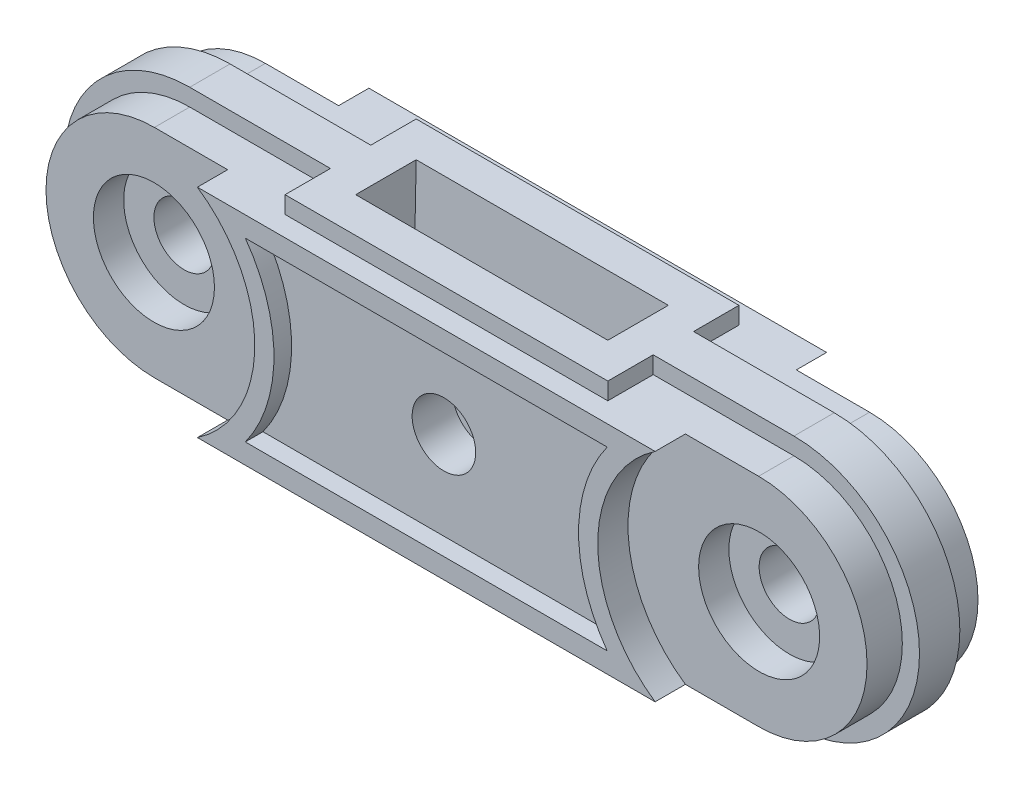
ISO-10303-21;
HEADER;
FILE_DESCRIPTION(('STEP AP214'),'2;1');
FILE_NAME('part.step','',(''),(''),'','','');
FILE_SCHEMA(('AUTOMOTIVE_DESIGN { 1 0 10303 214 1 1 1 1 }'));
ENDSEC;
DATA;
#1=APPLICATION_CONTEXT('core data for automotive mechanical design processes');
#2=APPLICATION_PROTOCOL_DEFINITION('international standard','automotive_design',2000,#1);
#3=PRODUCT_CONTEXT('',#1,'mechanical');
#4=PRODUCT('Part','Part','',(#3));
#5=PRODUCT_RELATED_PRODUCT_CATEGORY('part','',(#4));
#6=PRODUCT_DEFINITION_FORMATION('','',#4);
#7=PRODUCT_DEFINITION_CONTEXT('part definition',#1,'design');
#8=PRODUCT_DEFINITION('design','',#6,#7);
#9=PRODUCT_DEFINITION_SHAPE('','',#8);
#10=(LENGTH_UNIT() NAMED_UNIT(*) SI_UNIT(.MILLI.,.METRE.));
#11=(NAMED_UNIT(*) PLANE_ANGLE_UNIT() SI_UNIT($,.RADIAN.));
#12=(NAMED_UNIT(*) SI_UNIT($,.STERADIAN.) SOLID_ANGLE_UNIT());
#13=UNCERTAINTY_MEASURE_WITH_UNIT(LENGTH_MEASURE(1.E-05),#10,'distance_accuracy_value','');
#14=(GEOMETRIC_REPRESENTATION_CONTEXT(3) GLOBAL_UNCERTAINTY_ASSIGNED_CONTEXT((#13)) GLOBAL_UNIT_ASSIGNED_CONTEXT((#10,
#11,#12)) REPRESENTATION_CONTEXT('',''));
#15=CARTESIAN_POINT('',(0.,0.,0.));
#16=DIRECTION('',(0.,0.,1.));
#17=DIRECTION('',(1.,0.,0.));
#18=AXIS2_PLACEMENT_3D('',#15,#16,#17);
#19=CARTESIAN_POINT('',(30.,10.75,3.));
#20=DIRECTION('',(0.,0.,1.));
#21=DIRECTION('',(-1.,0.,0.));
#22=AXIS2_PLACEMENT_3D('',#19,#20,#21);
#23=PLANE('',#22);
#24=DIRECTION('',(1.,0.,0.));
#25=VECTOR('',#24,1.);
#26=CARTESIAN_POINT('',(-40.7,21.5,3.));
#27=LINE('',#26,#25);
#28=CARTESIAN_POINT('',(22.6899042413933,21.5,3.));
#29=VERTEX_POINT('',#28);
#30=CARTESIAN_POINT('',(29.95,21.5,3.));
#31=VERTEX_POINT('',#30);
#32=EDGE_CURVE('E61',#29,#31,#27,.T.);
#33=ORIENTED_EDGE('',*,*,#32,.T.);
#34=CARTESIAN_POINT('',(29.95,10.75,3.));
#35=DIRECTION('',(0.,0.,1.));
#36=DIRECTION('',(1.,0.,0.));
#37=AXIS2_PLACEMENT_3D('',#34,#35,#36);
#38=CIRCLE('',#37,10.75);
#39=CARTESIAN_POINT('',(29.95,0.,3.));
#40=VERTEX_POINT('',#39);
#41=EDGE_CURVE('E424',#31,#40,#38,.F.);
#42=ORIENTED_EDGE('',*,*,#41,.T.);
#43=DIRECTION('',(1.,0.,0.));
#44=VECTOR('',#43,1.);
#45=CARTESIAN_POINT('',(-40.7,0.,3.));
#46=LINE('',#45,#44);
#47=CARTESIAN_POINT('',(22.6899042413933,0.,3.));
#48=VERTEX_POINT('',#47);
#49=EDGE_CURVE('E427',#48,#40,#46,.T.);
#50=ORIENTED_EDGE('',*,*,#49,.F.);
#51=CARTESIAN_POINT('',(30.,10.75,3.));
#52=DIRECTION('',(0.,0.,1.));
#53=DIRECTION('',(-1.,0.,0.));
#54=AXIS2_PLACEMENT_3D('',#51,#52,#53);
#55=CIRCLE('',#54,13.);
#56=EDGE_CURVE('E356',#29,#48,#55,.T.);
#57=ORIENTED_EDGE('',*,*,#56,.F.);
#58=EDGE_LOOP('',(#33,#42,#50,#57));
#59=FACE_BOUND('',#58,.T.);
#60=CARTESIAN_POINT('',(30.,10.75,3.));
#61=DIRECTION('',(0.,0.,1.));
#62=DIRECTION('',(-1.,0.,0.));
#63=AXIS2_PLACEMENT_3D('',#60,#61,#62);
#64=CIRCLE('',#63,6.);
#65=CARTESIAN_POINT('',(24.,10.75,3.));
#66=VERTEX_POINT('',#65);
#67=EDGE_CURVE('E415',#66,#66,#64,.T.);
#68=ORIENTED_EDGE('',*,*,#67,.T.);
#69=EDGE_LOOP('',(#68));
#70=FACE_BOUND('',#69,.T.);
#71=ADVANCED_FACE('F44',(#59,#70),#23,.F.);
#72=CARTESIAN_POINT('',(-30.,10.75,17.));
#73=DIRECTION('',(0.,0.,-1.));
#74=DIRECTION('',(-1.,0.,0.));
#75=AXIS2_PLACEMENT_3D('',#72,#73,#74);
#76=CYLINDRICAL_SURFACE('',#75,3.);
#77=CARTESIAN_POINT('',(-30.,10.75,11.));
#78=DIRECTION('',(0.,0.,1.));
#79=DIRECTION('',(1.,0.,0.));
#80=AXIS2_PLACEMENT_3D('',#77,#78,#79);
#81=CIRCLE('',#80,3.);
#82=CARTESIAN_POINT('',(-27.,10.75,11.));
#83=VERTEX_POINT('',#82);
#84=EDGE_CURVE('E367',#83,#83,#81,.F.);
#85=ORIENTED_EDGE('',*,*,#84,.F.);
#86=EDGE_LOOP('',(#85));
#87=FACE_BOUND('',#86,.T.);
#88=CARTESIAN_POINT('',(-30.,10.75,5.99999999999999));
#89=DIRECTION('',(0.,0.,-1.));
#90=DIRECTION('',(-1.,0.,0.));
#91=AXIS2_PLACEMENT_3D('',#88,#89,#90);
#92=CIRCLE('',#91,3.);
#93=CARTESIAN_POINT('',(-33.,10.75,5.99999999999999));
#94=VERTEX_POINT('',#93);
#95=EDGE_CURVE('E399',#94,#94,#92,.F.);
#96=ORIENTED_EDGE('',*,*,#95,.F.);
#97=EDGE_LOOP('',(#96));
#98=FACE_BOUND('',#97,.T.);
#99=ADVANCED_FACE('F818',(#87,#98),#76,.F.);
#100=CARTESIAN_POINT('',(-30.,10.75,3.));
#101=DIRECTION('',(0.,0.,-1.));
#102=DIRECTION('',(1.,0.,0.));
#103=AXIS2_PLACEMENT_3D('',#100,#101,#102);
#104=PLANE('',#103);
#105=CARTESIAN_POINT('',(-30.,10.75,3.));
#106=DIRECTION('',(0.,0.,1.));
#107=DIRECTION('',(1.,0.,0.));
#108=AXIS2_PLACEMENT_3D('',#105,#106,#107);
#109=CIRCLE('',#108,13.);
#110=CARTESIAN_POINT('',(-22.6899042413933,0.,3.));
#111=VERTEX_POINT('',#110);
#112=CARTESIAN_POINT('',(-22.6899042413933,21.5,3.));
#113=VERTEX_POINT('',#112);
#114=EDGE_CURVE('E433',#111,#113,#109,.T.);
#115=ORIENTED_EDGE('',*,*,#114,.F.);
#116=DIRECTION('',(-1.,0.,0.));
#117=VECTOR('',#116,1.);
#118=CARTESIAN_POINT('',(-40.7,0.,3.));
#119=LINE('',#118,#117);
#120=CARTESIAN_POINT('',(-29.95,0.,3.));
#121=VERTEX_POINT('',#120);
#122=EDGE_CURVE('E69',#111,#121,#119,.T.);
#123=ORIENTED_EDGE('',*,*,#122,.T.);
#124=CARTESIAN_POINT('',(-29.95,10.75,3.));
#125=DIRECTION('',(0.,0.,-1.));
#126=DIRECTION('',(-1.,0.,0.));
#127=AXIS2_PLACEMENT_3D('',#124,#125,#126);
#128=CIRCLE('',#127,10.75);
#129=CARTESIAN_POINT('',(-29.95,21.5,3.));
#130=VERTEX_POINT('',#129);
#131=EDGE_CURVE('E389',#121,#130,#128,.T.);
#132=ORIENTED_EDGE('',*,*,#131,.T.);
#133=DIRECTION('',(-1.,0.,0.));
#134=VECTOR('',#133,1.);
#135=CARTESIAN_POINT('',(-40.7,21.5,3.));
#136=LINE('',#135,#134);
#137=EDGE_CURVE('E438',#113,#130,#136,.T.);
#138=ORIENTED_EDGE('',*,*,#137,.F.);
#139=EDGE_LOOP('',(#115,#123,#132,#138));
#140=FACE_BOUND('',#139,.T.);
#141=CARTESIAN_POINT('',(-30.,10.75,3.));
#142=DIRECTION('',(0.,0.,1.));
#143=DIRECTION('',(1.,0.,0.));
#144=AXIS2_PLACEMENT_3D('',#141,#142,#143);
#145=CIRCLE('',#144,6.);
#146=CARTESIAN_POINT('',(-24.,10.75,3.));
#147=VERTEX_POINT('',#146);
#148=EDGE_CURVE('E408',#147,#147,#145,.T.);
#149=ORIENTED_EDGE('',*,*,#148,.T.);
#150=EDGE_LOOP('',(#149));
#151=FACE_BOUND('',#150,.T.);
#152=ADVANCED_FACE('F823',(#140,#151),#104,.T.);
#153=CARTESIAN_POINT('',(-40.7,21.5,0.));
#154=DIRECTION('',(0.,1.,0.));
#155=DIRECTION('',(0.,0.,1.));
#156=AXIS2_PLACEMENT_3D('',#153,#154,#155);
#157=PLANE('',#156);
#158=ORIENTED_EDGE('',*,*,#32,.F.);
#159=DIRECTION('',(0.,0.,-1.));
#160=VECTOR('',#159,1.);
#161=CARTESIAN_POINT('',(22.6899042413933,21.5,3.));
#162=LINE('',#161,#160);
#163=CARTESIAN_POINT('',(22.6899042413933,21.5,0.));
#164=VERTEX_POINT('',#163);
#165=EDGE_CURVE('E430',#29,#164,#162,.T.);
#166=ORIENTED_EDGE('',*,*,#165,.T.);
#167=DIRECTION('',(-1.,0.,0.));
#168=VECTOR('',#167,1.);
#169=CARTESIAN_POINT('',(0.,21.5,0.));
#170=LINE('',#169,#168);
#171=CARTESIAN_POINT('',(-22.6899042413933,21.5,0.));
#172=VERTEX_POINT('',#171);
#173=EDGE_CURVE('E366',#164,#172,#170,.T.);
#174=ORIENTED_EDGE('',*,*,#173,.T.);
#175=DIRECTION('',(0.,0.,-1.));
#176=VECTOR('',#175,1.);
#177=CARTESIAN_POINT('',(-22.6899042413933,21.5,3.));
#178=LINE('',#177,#176);
#179=EDGE_CURVE('E441',#172,#113,#178,.F.);
#180=ORIENTED_EDGE('',*,*,#179,.T.);
#181=ORIENTED_EDGE('',*,*,#137,.T.);
#182=DIRECTION('',(0.,0.,-1.));
#183=VECTOR('',#182,1.);
#184=CARTESIAN_POINT('',(-29.95,21.5,17.));
#185=LINE('',#184,#183);
#186=CARTESIAN_POINT('',(-29.95,21.5,6.5));
#187=VERTEX_POINT('',#186);
#188=EDGE_CURVE('E738',#187,#130,#185,.T.);
#189=ORIENTED_EDGE('',*,*,#188,.F.);
#190=DIRECTION('',(-1.,0.,0.));
#191=VECTOR('',#190,1.);
#192=CARTESIAN_POINT('',(-29.95,21.5,6.5));
#193=LINE('',#192,#191);
#194=CARTESIAN_POINT('',(-16.,21.5,6.50000000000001));
#195=VERTEX_POINT('',#194);
#196=EDGE_CURVE('E674',#195,#187,#193,.T.);
#197=ORIENTED_EDGE('',*,*,#196,.F.);
#198=DIRECTION('',(0.,0.,1.));
#199=VECTOR('',#198,1.);
#200=CARTESIAN_POINT('',(-16.,21.5,6.50000000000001));
#201=LINE('',#200,#199);
#202=CARTESIAN_POINT('',(-16.,21.5,2.));
#203=VERTEX_POINT('',#202);
#204=EDGE_CURVE('E597',#203,#195,#201,.T.);
#205=ORIENTED_EDGE('',*,*,#204,.F.);
#206=DIRECTION('',(-1.,0.,0.));
#207=VECTOR('',#206,1.);
#208=CARTESIAN_POINT('',(-16.,21.5,2.));
#209=LINE('',#208,#207);
#210=CARTESIAN_POINT('',(16.,21.5,2.));
#211=VERTEX_POINT('',#210);
#212=EDGE_CURVE('E604',#211,#203,#209,.T.);
#213=ORIENTED_EDGE('',*,*,#212,.F.);
#214=DIRECTION('',(0.,0.,-1.));
#215=VECTOR('',#214,1.);
#216=CARTESIAN_POINT('',(16.,21.5,2.));
#217=LINE('',#216,#215);
#218=CARTESIAN_POINT('',(16.,21.5,6.50000000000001));
#219=VERTEX_POINT('',#218);
#220=EDGE_CURVE('E593',#219,#211,#217,.T.);
#221=ORIENTED_EDGE('',*,*,#220,.F.);
#222=CARTESIAN_POINT('',(29.95,21.5,6.5));
#223=VERTEX_POINT('',#222);
#224=EDGE_CURVE('E653',#223,#219,#193,.T.);
#225=ORIENTED_EDGE('',*,*,#224,.F.);
#226=DIRECTION('',(0.,0.,-1.));
#227=VECTOR('',#226,1.);
#228=CARTESIAN_POINT('',(29.95,21.5,17.));
#229=LINE('',#228,#227);
#230=EDGE_CURVE('E753',#223,#31,#229,.T.);
#231=ORIENTED_EDGE('',*,*,#230,.T.);
#232=EDGE_LOOP('',(#158,#166,#174,#180,#181,#189,#197,#205,#213,#221,#225,#231));
#233=FACE_BOUND('',#232,.T.);
#234=ADVANCED_FACE('F837',(#233),#157,.T.);
#235=CARTESIAN_POINT('',(0.,21.5,0.));
#236=DIRECTION('',(0.,0.,1.));
#237=DIRECTION('',(1.,0.,0.));
#238=AXIS2_PLACEMENT_3D('',#235,#236,#237);
#239=PLANE('',#238);
#240=CARTESIAN_POINT('',(30.,10.75,0.));
#241=DIRECTION('',(0.,0.,-1.));
#242=DIRECTION('',(1.,0.,0.));
#243=AXIS2_PLACEMENT_3D('',#240,#241,#242);
#244=CIRCLE('',#243,14.9);
#245=CARTESIAN_POINT('',(17.9398383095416,1.99999999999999,0.));
#246=VERTEX_POINT('',#245);
#247=CARTESIAN_POINT('',(17.9398383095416,19.5,0.));
#248=VERTEX_POINT('',#247);
#249=EDGE_CURVE('E617',#246,#248,#244,.T.);
#250=ORIENTED_EDGE('',*,*,#249,.T.);
#251=DIRECTION('',(-1.,0.,0.));
#252=VECTOR('',#251,1.);
#253=CARTESIAN_POINT('',(-17.9398383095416,19.5,0.));
#254=LINE('',#253,#252);
#255=CARTESIAN_POINT('',(-17.9398383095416,19.5,0.));
#256=VERTEX_POINT('',#255);
#257=EDGE_CURVE('E622',#248,#256,#254,.T.);
#258=ORIENTED_EDGE('',*,*,#257,.T.);
#259=CARTESIAN_POINT('',(-30.,10.75,0.));
#260=DIRECTION('',(0.,0.,-1.));
#261=DIRECTION('',(-1.,0.,0.));
#262=AXIS2_PLACEMENT_3D('',#259,#260,#261);
#263=CIRCLE('',#262,14.9);
#264=CARTESIAN_POINT('',(-17.9398383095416,2.,0.));
#265=VERTEX_POINT('',#264);
#266=EDGE_CURVE('E634',#256,#265,#263,.T.);
#267=ORIENTED_EDGE('',*,*,#266,.T.);
#268=DIRECTION('',(1.,0.,0.));
#269=VECTOR('',#268,1.);
#270=CARTESIAN_POINT('',(17.9398383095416,2.,0.));
#271=LINE('',#270,#269);
#272=EDGE_CURVE('E631',#265,#246,#271,.T.);
#273=ORIENTED_EDGE('',*,*,#272,.T.);
#274=EDGE_LOOP('',(#250,#258,#267,#273));
#275=FACE_BOUND('',#274,.T.);
#276=CARTESIAN_POINT('',(30.,10.75,0.));
#277=DIRECTION('',(0.,0.,1.));
#278=DIRECTION('',(-1.,0.,0.));
#279=AXIS2_PLACEMENT_3D('',#276,#277,#278);
#280=CIRCLE('',#279,13.);
#281=CARTESIAN_POINT('',(22.6899042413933,0.,0.));
#282=VERTEX_POINT('',#281);
#283=EDGE_CURVE('E354',#164,#282,#280,.T.);
#284=ORIENTED_EDGE('',*,*,#283,.T.);
#285=DIRECTION('',(-1.,0.,0.));
#286=VECTOR('',#285,1.);
#287=CARTESIAN_POINT('',(0.,0.,0.));
#288=LINE('',#287,#286);
#289=CARTESIAN_POINT('',(-22.6899042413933,0.,0.));
#290=VERTEX_POINT('',#289);
#291=EDGE_CURVE('E364',#282,#290,#288,.T.);
#292=ORIENTED_EDGE('',*,*,#291,.T.);
#293=CARTESIAN_POINT('',(-30.,10.75,0.));
#294=DIRECTION('',(0.,0.,1.));
#295=DIRECTION('',(1.,0.,0.));
#296=AXIS2_PLACEMENT_3D('',#293,#294,#295);
#297=CIRCLE('',#296,13.);
#298=EDGE_CURVE('E432',#290,#172,#297,.T.);
#299=ORIENTED_EDGE('',*,*,#298,.T.);
#300=ORIENTED_EDGE('',*,*,#173,.F.);
#301=EDGE_LOOP('',(#284,#292,#299,#300));
#302=FACE_BOUND('',#301,.T.);
#303=ADVANCED_FACE('F362',(#275,#302),#239,.F.);
#304=CARTESIAN_POINT('',(-40.7,0.,0.));
#305=DIRECTION('',(0.,1.,0.));
#306=DIRECTION('',(0.,0.,1.));
#307=AXIS2_PLACEMENT_3D('',#304,#305,#306);
#308=PLANE('',#307);
#309=DIRECTION('',(0.,0.,-1.));
#310=VECTOR('',#309,1.);
#311=CARTESIAN_POINT('',(22.6899042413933,0.,3.));
#312=LINE('',#311,#310);
#313=EDGE_CURVE('E13',#48,#282,#312,.T.);
#314=ORIENTED_EDGE('',*,*,#313,.F.);
#315=ORIENTED_EDGE('',*,*,#49,.T.);
#316=DIRECTION('',(0.,0.,-1.));
#317=VECTOR('',#316,1.);
#318=CARTESIAN_POINT('',(29.95,0.,17.));
#319=LINE('',#318,#317);
#320=CARTESIAN_POINT('',(29.95,0.,6.5));
#321=VERTEX_POINT('',#320);
#322=EDGE_CURVE('E750',#321,#40,#319,.T.);
#323=ORIENTED_EDGE('',*,*,#322,.F.);
#324=DIRECTION('',(1.,0.,0.));
#325=VECTOR('',#324,1.);
#326=CARTESIAN_POINT('',(-29.95,0.,6.5));
#327=LINE('',#326,#325);
#328=CARTESIAN_POINT('',(16.,0.,6.50000000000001));
#329=VERTEX_POINT('',#328);
#330=EDGE_CURVE('E667',#329,#321,#327,.T.);
#331=ORIENTED_EDGE('',*,*,#330,.F.);
#332=DIRECTION('',(0.,0.,-1.));
#333=VECTOR('',#332,1.);
#334=CARTESIAN_POINT('',(16.,0.,2.));
#335=LINE('',#334,#333);
#336=CARTESIAN_POINT('',(16.,0.,2.));
#337=VERTEX_POINT('',#336);
#338=EDGE_CURVE('E518',#329,#337,#335,.T.);
#339=ORIENTED_EDGE('',*,*,#338,.T.);
#340=DIRECTION('',(-1.,0.,0.));
#341=VECTOR('',#340,1.);
#342=CARTESIAN_POINT('',(-16.,0.,2.));
#343=LINE('',#342,#341);
#344=CARTESIAN_POINT('',(-16.,0.,2.));
#345=VERTEX_POINT('',#344);
#346=EDGE_CURVE('E527',#337,#345,#343,.T.);
#347=ORIENTED_EDGE('',*,*,#346,.T.);
#348=DIRECTION('',(0.,0.,1.));
#349=VECTOR('',#348,1.);
#350=CARTESIAN_POINT('',(-16.,0.,6.50000000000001));
#351=LINE('',#350,#349);
#352=CARTESIAN_POINT('',(-16.,0.,6.50000000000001));
#353=VERTEX_POINT('',#352);
#354=EDGE_CURVE('E506',#345,#353,#351,.T.);
#355=ORIENTED_EDGE('',*,*,#354,.T.);
#356=CARTESIAN_POINT('',(-29.95,0.,6.5));
#357=VERTEX_POINT('',#356);
#358=EDGE_CURVE('E668',#357,#353,#327,.T.);
#359=ORIENTED_EDGE('',*,*,#358,.F.);
#360=DIRECTION('',(0.,0.,-1.));
#361=VECTOR('',#360,1.);
#362=CARTESIAN_POINT('',(-29.95,0.,17.));
#363=LINE('',#362,#361);
#364=EDGE_CURVE('E747',#357,#121,#363,.T.);
#365=ORIENTED_EDGE('',*,*,#364,.T.);
#366=ORIENTED_EDGE('',*,*,#122,.F.);
#367=DIRECTION('',(0.,0.,-1.));
#368=VECTOR('',#367,1.);
#369=CARTESIAN_POINT('',(-22.6899042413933,0.,3.));
#370=LINE('',#369,#368);
#371=EDGE_CURVE('E53',#290,#111,#370,.F.);
#372=ORIENTED_EDGE('',*,*,#371,.F.);
#373=ORIENTED_EDGE('',*,*,#291,.F.);
#374=EDGE_LOOP('',(#314,#315,#323,#331,#339,#347,#355,#359,#365,#366,#372,#373));
#375=FACE_BOUND('',#374,.T.);
#376=ADVANCED_FACE('F370',(#375),#308,.F.);
#377=CARTESIAN_POINT('',(-29.95,10.75,17.));
#378=DIRECTION('',(0.,0.,-1.));
#379=DIRECTION('',(-1.,0.,0.));
#380=AXIS2_PLACEMENT_3D('',#377,#378,#379);
#381=CYLINDRICAL_SURFACE('',#380,10.75);
#382=ORIENTED_EDGE('',*,*,#131,.F.);
#383=ORIENTED_EDGE('',*,*,#364,.F.);
#384=CARTESIAN_POINT('',(-29.95,10.75,6.5));
#385=DIRECTION('',(0.,0.,1.));
#386=DIRECTION('',(1.,0.,0.));
#387=AXIS2_PLACEMENT_3D('',#384,#385,#386);
#388=CIRCLE('',#387,10.75);
#389=EDGE_CURVE('E642',#187,#357,#388,.T.);
#390=ORIENTED_EDGE('',*,*,#389,.F.);
#391=ORIENTED_EDGE('',*,*,#188,.T.);
#392=EDGE_LOOP('',(#382,#383,#390,#391));
#393=FACE_BOUND('',#392,.T.);
#394=ADVANCED_FACE('F1107',(#393),#381,.T.);
#395=CARTESIAN_POINT('',(-29.95,10.75,14.));
#396=DIRECTION('',(0.,0.,1.));
#397=DIRECTION('',(1.,0.,0.));
#398=AXIS2_PLACEMENT_3D('',#395,#396,#397);
#399=CIRCLE('',#398,10.75);
#400=CARTESIAN_POINT('',(-29.95,21.5,14.));
#401=VERTEX_POINT('',#400);
#402=CARTESIAN_POINT('',(-29.95,0.,14.));
#403=VERTEX_POINT('',#402);
#404=EDGE_CURVE('E385',#401,#403,#399,.T.);
#405=ORIENTED_EDGE('',*,*,#404,.F.);
#406=CARTESIAN_POINT('',(-29.95,21.5,10.5));
#407=VERTEX_POINT('',#406);
#408=EDGE_CURVE('E745',#401,#407,#185,.T.);
#409=ORIENTED_EDGE('',*,*,#408,.T.);
#410=CARTESIAN_POINT('',(-29.95,10.75,10.5));
#411=DIRECTION('',(0.,0.,1.));
#412=DIRECTION('',(1.,0.,0.));
#413=AXIS2_PLACEMENT_3D('',#410,#411,#412);
#414=CIRCLE('',#413,10.75);
#415=CARTESIAN_POINT('',(-29.95,0.,10.5));
#416=VERTEX_POINT('',#415);
#417=EDGE_CURVE('E649',#407,#416,#414,.T.);
#418=ORIENTED_EDGE('',*,*,#417,.T.);
#419=EDGE_CURVE('E748',#403,#416,#363,.T.);
#420=ORIENTED_EDGE('',*,*,#419,.F.);
#421=EDGE_LOOP('',(#405,#409,#418,#420));
#422=FACE_BOUND('',#421,.T.);
#423=ADVANCED_FACE('F1115',(#422),#381,.T.);
#424=CARTESIAN_POINT('',(29.95,10.75,6.5));
#425=DIRECTION('',(0.,0.,1.));
#426=DIRECTION('',(1.,0.,0.));
#427=AXIS2_PLACEMENT_3D('',#424,#425,#426);
#428=PLANE('',#427);
#429=ORIENTED_EDGE('',*,*,#358,.T.);
#430=DIRECTION('',(0.,1.,0.));
#431=VECTOR('',#430,1.);
#432=CARTESIAN_POINT('',(-16.,-1.7,6.50000000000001));
#433=LINE('',#432,#431);
#434=CARTESIAN_POINT('',(-16.,-1.7,6.50000000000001));
#435=VERTEX_POINT('',#434);
#436=EDGE_CURVE('E538',#435,#353,#433,.T.);
#437=ORIENTED_EDGE('',*,*,#436,.F.);
#438=DIRECTION('',(1.,0.,0.));
#439=VECTOR('',#438,1.);
#440=CARTESIAN_POINT('',(-29.95,-1.7,6.5));
#441=LINE('',#440,#439);
#442=CARTESIAN_POINT('',(-29.95,-1.7,6.5));
#443=VERTEX_POINT('',#442);
#444=EDGE_CURVE('E681',#443,#435,#441,.T.);
#445=ORIENTED_EDGE('',*,*,#444,.F.);
#446=CARTESIAN_POINT('',(-29.95,10.75,6.5));
#447=DIRECTION('',(0.,0.,1.));
#448=DIRECTION('',(1.,0.,0.));
#449=AXIS2_PLACEMENT_3D('',#446,#447,#448);
#450=CIRCLE('',#449,12.45);
#451=CARTESIAN_POINT('',(-29.95,23.2,6.5));
#452=VERTEX_POINT('',#451);
#453=EDGE_CURVE('E696',#452,#443,#450,.T.);
#454=ORIENTED_EDGE('',*,*,#453,.F.);
#455=DIRECTION('',(-1.,0.,0.));
#456=VECTOR('',#455,1.);
#457=CARTESIAN_POINT('',(-29.95,23.2,6.5));
#458=LINE('',#457,#456);
#459=CARTESIAN_POINT('',(-16.,23.2,6.5));
#460=VERTEX_POINT('',#459);
#461=EDGE_CURVE('E692',#460,#452,#458,.T.);
#462=ORIENTED_EDGE('',*,*,#461,.F.);
#463=DIRECTION('',(0.,-1.,0.));
#464=VECTOR('',#463,1.);
#465=CARTESIAN_POINT('',(-16.,23.2,6.50000000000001));
#466=LINE('',#465,#464);
#467=EDGE_CURVE('E602',#460,#195,#466,.T.);
#468=ORIENTED_EDGE('',*,*,#467,.T.);
#469=ORIENTED_EDGE('',*,*,#196,.T.);
#470=ORIENTED_EDGE('',*,*,#389,.T.);
#471=EDGE_LOOP('',(#429,#437,#445,#454,#462,#468,#469,#470));
#472=FACE_BOUND('',#471,.T.);
#473=ADVANCED_FACE('F1315',(#472),#428,.F.);
#474=DIRECTION('',(-1.,0.,0.));
#475=VECTOR('',#474,1.);
#476=CARTESIAN_POINT('',(-40.7,0.,14.));
#477=LINE('',#476,#475);
#478=CARTESIAN_POINT('',(29.95,0.,14.));
#479=VERTEX_POINT('',#478);
#480=CARTESIAN_POINT('',(22.6899042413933,0.,14.));
#481=VERTEX_POINT('',#480);
#482=EDGE_CURVE('E451',#479,#481,#477,.T.);
#483=ORIENTED_EDGE('',*,*,#482,.T.);
#484=DIRECTION('',(0.,0.,1.));
#485=VECTOR('',#484,1.);
#486=CARTESIAN_POINT('',(22.6899042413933,0.,14.));
#487=LINE('',#486,#485);
#488=CARTESIAN_POINT('',(22.6899042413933,0.,17.));
#489=VERTEX_POINT('',#488);
#490=EDGE_CURVE('E456',#481,#489,#487,.T.);
#491=ORIENTED_EDGE('',*,*,#490,.T.);
#492=DIRECTION('',(1.,0.,0.));
#493=VECTOR('',#492,1.);
#494=CARTESIAN_POINT('',(40.7,0.,17.));
#495=LINE('',#494,#493);
#496=CARTESIAN_POINT('',(-22.6899042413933,0.,17.));
#497=VERTEX_POINT('',#496);
#498=EDGE_CURVE('E371',#497,#489,#495,.T.);
#499=ORIENTED_EDGE('',*,*,#498,.F.);
#500=DIRECTION('',(0.,0.,1.));
#501=VECTOR('',#500,1.);
#502=CARTESIAN_POINT('',(-22.6899042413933,0.,14.));
#503=LINE('',#502,#501);
#504=CARTESIAN_POINT('',(-22.6899042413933,0.,14.));
#505=VERTEX_POINT('',#504);
#506=EDGE_CURVE('E471',#497,#505,#503,.F.);
#507=ORIENTED_EDGE('',*,*,#506,.T.);
#508=DIRECTION('',(1.,0.,0.));
#509=VECTOR('',#508,1.);
#510=CARTESIAN_POINT('',(-40.7,0.,14.));
#511=LINE('',#510,#509);
#512=EDGE_CURVE('E467',#403,#505,#511,.T.);
#513=ORIENTED_EDGE('',*,*,#512,.F.);
#514=ORIENTED_EDGE('',*,*,#419,.T.);
#515=DIRECTION('',(1.,0.,0.));
#516=VECTOR('',#515,1.);
#517=CARTESIAN_POINT('',(-29.95,0.,10.5));
#518=LINE('',#517,#516);
#519=CARTESIAN_POINT('',(-16.,0.,10.5));
#520=VERTEX_POINT('',#519);
#521=EDGE_CURVE('E654',#416,#520,#518,.T.);
#522=ORIENTED_EDGE('',*,*,#521,.T.);
#523=DIRECTION('',(0.,0.,-1.));
#524=VECTOR('',#523,1.);
#525=CARTESIAN_POINT('',(-16.,0.,10.5));
#526=LINE('',#525,#524);
#527=CARTESIAN_POINT('',(-16.,0.,15.));
#528=VERTEX_POINT('',#527);
#529=EDGE_CURVE('E544',#528,#520,#526,.T.);
#530=ORIENTED_EDGE('',*,*,#529,.F.);
#531=DIRECTION('',(-1.,0.,0.));
#532=VECTOR('',#531,1.);
#533=CARTESIAN_POINT('',(-16.,0.,15.));
#534=LINE('',#533,#532);
#535=CARTESIAN_POINT('',(16.,0.,15.));
#536=VERTEX_POINT('',#535);
#537=EDGE_CURVE('E552',#536,#528,#534,.T.);
#538=ORIENTED_EDGE('',*,*,#537,.F.);
#539=DIRECTION('',(0.,0.,1.));
#540=VECTOR('',#539,1.);
#541=CARTESIAN_POINT('',(16.,0.,15.));
#542=LINE('',#541,#540);
#543=CARTESIAN_POINT('',(16.,0.,10.5));
#544=VERTEX_POINT('',#543);
#545=EDGE_CURVE('E540',#544,#536,#542,.T.);
#546=ORIENTED_EDGE('',*,*,#545,.F.);
#547=CARTESIAN_POINT('',(29.95,0.,10.5));
#548=VERTEX_POINT('',#547);
#549=EDGE_CURVE('E652',#544,#548,#518,.T.);
#550=ORIENTED_EDGE('',*,*,#549,.T.);
#551=EDGE_CURVE('E751',#479,#548,#319,.T.);
#552=ORIENTED_EDGE('',*,*,#551,.F.);
#553=EDGE_LOOP('',(#483,#491,#499,#507,#513,#514,#522,#530,#538,#546,#550,#552));
#554=FACE_BOUND('',#553,.T.);
#555=ADVANCED_FACE('F769',(#554),#308,.F.);
#556=CARTESIAN_POINT('',(29.95,10.75,10.5));
#557=DIRECTION('',(0.,0.,1.));
#558=DIRECTION('',(1.,0.,0.));
#559=AXIS2_PLACEMENT_3D('',#556,#557,#558);
#560=PLANE('',#559);
#561=ORIENTED_EDGE('',*,*,#549,.F.);
#562=DIRECTION('',(0.,1.,0.));
#563=VECTOR('',#562,1.);
#564=CARTESIAN_POINT('',(16.,-1.7,10.5));
#565=LINE('',#564,#563);
#566=CARTESIAN_POINT('',(16.,-1.7,10.5));
#567=VERTEX_POINT('',#566);
#568=EDGE_CURVE('E564',#567,#544,#565,.T.);
#569=ORIENTED_EDGE('',*,*,#568,.F.);
#570=DIRECTION('',(1.,0.,0.));
#571=VECTOR('',#570,1.);
#572=CARTESIAN_POINT('',(-29.95,-1.7,10.5));
#573=LINE('',#572,#571);
#574=CARTESIAN_POINT('',(29.95,-1.7,10.5));
#575=VERTEX_POINT('',#574);
#576=EDGE_CURVE('E686',#567,#575,#573,.T.);
#577=ORIENTED_EDGE('',*,*,#576,.T.);
#578=CARTESIAN_POINT('',(29.95,10.75,10.5));
#579=DIRECTION('',(0.,0.,1.));
#580=DIRECTION('',(1.,0.,0.));
#581=AXIS2_PLACEMENT_3D('',#578,#579,#580);
#582=CIRCLE('',#581,12.45);
#583=CARTESIAN_POINT('',(29.95,23.2,10.5));
#584=VERTEX_POINT('',#583);
#585=EDGE_CURVE('E677',#575,#584,#582,.T.);
#586=ORIENTED_EDGE('',*,*,#585,.T.);
#587=DIRECTION('',(-1.,0.,0.));
#588=VECTOR('',#587,1.);
#589=CARTESIAN_POINT('',(-29.95,23.2,10.5));
#590=LINE('',#589,#588);
#591=CARTESIAN_POINT('',(16.,23.2,10.5));
#592=VERTEX_POINT('',#591);
#593=EDGE_CURVE('E682',#584,#592,#590,.T.);
#594=ORIENTED_EDGE('',*,*,#593,.T.);
#595=DIRECTION('',(0.,-1.,0.));
#596=VECTOR('',#595,1.);
#597=CARTESIAN_POINT('',(16.,23.2,10.5));
#598=LINE('',#597,#596);
#599=CARTESIAN_POINT('',(16.,21.5,10.5));
#600=VERTEX_POINT('',#599);
#601=EDGE_CURVE('E578',#592,#600,#598,.T.);
#602=ORIENTED_EDGE('',*,*,#601,.T.);
#603=DIRECTION('',(-1.,0.,0.));
#604=VECTOR('',#603,1.);
#605=CARTESIAN_POINT('',(-29.95,21.5,10.5));
#606=LINE('',#605,#604);
#607=CARTESIAN_POINT('',(29.95,21.5,10.5));
#608=VERTEX_POINT('',#607);
#609=EDGE_CURVE('E661',#608,#600,#606,.T.);
#610=ORIENTED_EDGE('',*,*,#609,.F.);
#611=CARTESIAN_POINT('',(29.95,10.75,10.5));
#612=DIRECTION('',(0.,0.,1.));
#613=DIRECTION('',(1.,0.,0.));
#614=AXIS2_PLACEMENT_3D('',#611,#612,#613);
#615=CIRCLE('',#614,10.75);
#616=EDGE_CURVE('E657',#548,#608,#615,.T.);
#617=ORIENTED_EDGE('',*,*,#616,.F.);
#618=EDGE_LOOP('',(#561,#569,#577,#586,#594,#602,#610,#617));
#619=FACE_BOUND('',#618,.T.);
#620=ADVANCED_FACE('F783',(#619),#560,.T.);
#621=CARTESIAN_POINT('',(-29.95,-1.7,10.5));
#622=VERTEX_POINT('',#621);
#623=CARTESIAN_POINT('',(-16.,-1.7,10.5));
#624=VERTEX_POINT('',#623);
#625=EDGE_CURVE('E687',#622,#624,#573,.T.);
#626=ORIENTED_EDGE('',*,*,#625,.T.);
#627=DIRECTION('',(0.,1.,0.));
#628=VECTOR('',#627,1.);
#629=CARTESIAN_POINT('',(-16.,-1.7,10.5));
#630=LINE('',#629,#628);
#631=EDGE_CURVE('E549',#624,#520,#630,.T.);
#632=ORIENTED_EDGE('',*,*,#631,.T.);
#633=ORIENTED_EDGE('',*,*,#521,.F.);
#634=ORIENTED_EDGE('',*,*,#417,.F.);
#635=CARTESIAN_POINT('',(-16.,21.5,10.5));
#636=VERTEX_POINT('',#635);
#637=EDGE_CURVE('E660',#636,#407,#606,.T.);
#638=ORIENTED_EDGE('',*,*,#637,.F.);
#639=DIRECTION('',(0.,-1.,0.));
#640=VECTOR('',#639,1.);
#641=CARTESIAN_POINT('',(-16.,23.2,10.5));
#642=LINE('',#641,#640);
#643=CARTESIAN_POINT('',(-16.,23.2,10.5));
#644=VERTEX_POINT('',#643);
#645=EDGE_CURVE('E590',#644,#636,#642,.T.);
#646=ORIENTED_EDGE('',*,*,#645,.F.);
#647=CARTESIAN_POINT('',(-29.95,23.2,10.5));
#648=VERTEX_POINT('',#647);
#649=EDGE_CURVE('E680',#644,#648,#590,.T.);
#650=ORIENTED_EDGE('',*,*,#649,.T.);
#651=CARTESIAN_POINT('',(-29.95,10.75,10.5));
#652=DIRECTION('',(0.,0.,1.));
#653=DIRECTION('',(1.,0.,0.));
#654=AXIS2_PLACEMENT_3D('',#651,#652,#653);
#655=CIRCLE('',#654,12.45);
#656=EDGE_CURVE('E684',#648,#622,#655,.T.);
#657=ORIENTED_EDGE('',*,*,#656,.T.);
#658=EDGE_LOOP('',(#626,#632,#633,#634,#638,#646,#650,#657));
#659=FACE_BOUND('',#658,.T.);
#660=ADVANCED_FACE('F803',(#659),#560,.T.);
#661=CARTESIAN_POINT('',(16.,-1.7,6.5));
#662=VERTEX_POINT('',#661);
#663=CARTESIAN_POINT('',(29.95,-1.7,6.5));
#664=VERTEX_POINT('',#663);
#665=EDGE_CURVE('E698',#662,#664,#441,.T.);
#666=ORIENTED_EDGE('',*,*,#665,.F.);
#667=DIRECTION('',(0.,1.,0.));
#668=VECTOR('',#667,1.);
#669=CARTESIAN_POINT('',(16.,-1.7,6.50000000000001));
#670=LINE('',#669,#668);
#671=EDGE_CURVE('E524',#662,#329,#670,.T.);
#672=ORIENTED_EDGE('',*,*,#671,.T.);
#673=ORIENTED_EDGE('',*,*,#330,.T.);
#674=CARTESIAN_POINT('',(29.95,10.75,6.5));
#675=DIRECTION('',(0.,0.,1.));
#676=DIRECTION('',(1.,0.,0.));
#677=AXIS2_PLACEMENT_3D('',#674,#675,#676);
#678=CIRCLE('',#677,10.75);
#679=EDGE_CURVE('E671',#321,#223,#678,.T.);
#680=ORIENTED_EDGE('',*,*,#679,.T.);
#681=ORIENTED_EDGE('',*,*,#224,.T.);
#682=DIRECTION('',(0.,-1.,0.));
#683=VECTOR('',#682,1.);
#684=CARTESIAN_POINT('',(16.,23.2,6.50000000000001));
#685=LINE('',#684,#683);
#686=CARTESIAN_POINT('',(16.,23.2,6.50000000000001));
#687=VERTEX_POINT('',#686);
#688=EDGE_CURVE('E615',#687,#219,#685,.T.);
#689=ORIENTED_EDGE('',*,*,#688,.F.);
#690=CARTESIAN_POINT('',(29.95,23.2,6.5));
#691=VERTEX_POINT('',#690);
#692=EDGE_CURVE('E693',#691,#687,#458,.T.);
#693=ORIENTED_EDGE('',*,*,#692,.F.);
#694=CARTESIAN_POINT('',(29.95,10.75,6.5));
#695=DIRECTION('',(0.,0.,1.));
#696=DIRECTION('',(1.,0.,0.));
#697=AXIS2_PLACEMENT_3D('',#694,#695,#696);
#698=CIRCLE('',#697,12.45);
#699=EDGE_CURVE('E664',#664,#691,#698,.T.);
#700=ORIENTED_EDGE('',*,*,#699,.F.);
#701=EDGE_LOOP('',(#666,#672,#673,#680,#681,#689,#693,#700));
#702=FACE_BOUND('',#701,.T.);
#703=ADVANCED_FACE('F1127',(#702),#428,.F.);
#704=CARTESIAN_POINT('',(29.95,10.75,17.));
#705=DIRECTION('',(0.,0.,-1.));
#706=DIRECTION('',(-1.,0.,0.));
#707=AXIS2_PLACEMENT_3D('',#704,#705,#706);
#708=CYLINDRICAL_SURFACE('',#707,10.75);
#709=ORIENTED_EDGE('',*,*,#41,.F.);
#710=ORIENTED_EDGE('',*,*,#230,.F.);
#711=ORIENTED_EDGE('',*,*,#679,.F.);
#712=ORIENTED_EDGE('',*,*,#322,.T.);
#713=EDGE_LOOP('',(#709,#710,#711,#712));
#714=FACE_BOUND('',#713,.T.);
#715=ADVANCED_FACE('F1123',(#714),#708,.T.);
#716=DIRECTION('',(0.,0.,1.));
#717=VECTOR('',#716,1.);
#718=CARTESIAN_POINT('',(22.6899042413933,21.5,14.));
#719=LINE('',#718,#717);
#720=CARTESIAN_POINT('',(22.6899042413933,21.5,14.));
#721=VERTEX_POINT('',#720);
#722=CARTESIAN_POINT('',(22.6899042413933,21.5,17.));
#723=VERTEX_POINT('',#722);
#724=EDGE_CURVE('E454',#721,#723,#719,.T.);
#725=ORIENTED_EDGE('',*,*,#724,.F.);
#726=DIRECTION('',(-1.,0.,0.));
#727=VECTOR('',#726,1.);
#728=CARTESIAN_POINT('',(-40.7,21.5,14.));
#729=LINE('',#728,#727);
#730=CARTESIAN_POINT('',(29.95,21.5,14.));
#731=VERTEX_POINT('',#730);
#732=EDGE_CURVE('E448',#731,#721,#729,.T.);
#733=ORIENTED_EDGE('',*,*,#732,.F.);
#734=EDGE_CURVE('E376',#731,#608,#229,.T.);
#735=ORIENTED_EDGE('',*,*,#734,.T.);
#736=ORIENTED_EDGE('',*,*,#609,.T.);
#737=DIRECTION('',(0.,0.,1.));
#738=VECTOR('',#737,1.);
#739=CARTESIAN_POINT('',(16.,21.5,15.));
#740=LINE('',#739,#738);
#741=CARTESIAN_POINT('',(16.,21.5,15.));
#742=VERTEX_POINT('',#741);
#743=EDGE_CURVE('E572',#600,#742,#740,.T.);
#744=ORIENTED_EDGE('',*,*,#743,.T.);
#745=DIRECTION('',(-1.,0.,0.));
#746=VECTOR('',#745,1.);
#747=CARTESIAN_POINT('',(-16.,21.5,15.));
#748=LINE('',#747,#746);
#749=CARTESIAN_POINT('',(-16.,21.5,15.));
#750=VERTEX_POINT('',#749);
#751=EDGE_CURVE('E580',#742,#750,#748,.T.);
#752=ORIENTED_EDGE('',*,*,#751,.T.);
#753=DIRECTION('',(0.,0.,-1.));
#754=VECTOR('',#753,1.);
#755=CARTESIAN_POINT('',(-16.,21.5,10.5));
#756=LINE('',#755,#754);
#757=EDGE_CURVE('E567',#750,#636,#756,.T.);
#758=ORIENTED_EDGE('',*,*,#757,.T.);
#759=ORIENTED_EDGE('',*,*,#637,.T.);
#760=ORIENTED_EDGE('',*,*,#408,.F.);
#761=DIRECTION('',(1.,0.,0.));
#762=VECTOR('',#761,1.);
#763=CARTESIAN_POINT('',(-40.7,21.5,14.));
#764=LINE('',#763,#762);
#765=CARTESIAN_POINT('',(-22.6899042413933,21.5,14.));
#766=VERTEX_POINT('',#765);
#767=EDGE_CURVE('E463',#401,#766,#764,.T.);
#768=ORIENTED_EDGE('',*,*,#767,.T.);
#769=DIRECTION('',(0.,0.,1.));
#770=VECTOR('',#769,1.);
#771=CARTESIAN_POINT('',(-22.6899042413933,21.5,14.));
#772=LINE('',#771,#770);
#773=CARTESIAN_POINT('',(-22.6899042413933,21.5,17.));
#774=VERTEX_POINT('',#773);
#775=EDGE_CURVE('E469',#774,#766,#772,.F.);
#776=ORIENTED_EDGE('',*,*,#775,.F.);
#777=DIRECTION('',(1.,0.,0.));
#778=VECTOR('',#777,1.);
#779=CARTESIAN_POINT('',(-40.7,21.5,17.));
#780=LINE('',#779,#778);
#781=EDGE_CURVE('E373',#774,#723,#780,.T.);
#782=ORIENTED_EDGE('',*,*,#781,.T.);
#783=EDGE_LOOP('',(#725,#733,#735,#736,#744,#752,#758,#759,#760,#768,#776,#782));
#784=FACE_BOUND('',#783,.T.);
#785=ADVANCED_FACE('F759',(#784),#157,.T.);
#786=CARTESIAN_POINT('',(40.7,21.5,17.));
#787=DIRECTION('',(0.,0.,-1.));
#788=DIRECTION('',(-1.,0.,0.));
#789=AXIS2_PLACEMENT_3D('',#786,#787,#788);
#790=PLANE('',#789);
#791=DIRECTION('',(-1.,0.,0.));
#792=VECTOR('',#791,1.);
#793=CARTESIAN_POINT('',(-17.9398383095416,19.5,17.));
#794=LINE('',#793,#792);
#795=CARTESIAN_POINT('',(17.9398383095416,19.5,17.));
#796=VERTEX_POINT('',#795);
#797=CARTESIAN_POINT('',(-17.9398383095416,19.5,17.));
#798=VERTEX_POINT('',#797);
#799=EDGE_CURVE('E728',#796,#798,#794,.T.);
#800=ORIENTED_EDGE('',*,*,#799,.F.);
#801=CARTESIAN_POINT('',(30.,10.75,17.));
#802=DIRECTION('',(0.,0.,-1.));
#803=DIRECTION('',(1.,0.,0.));
#804=AXIS2_PLACEMENT_3D('',#801,#802,#803);
#805=CIRCLE('',#804,14.9);
#806=CARTESIAN_POINT('',(17.9398383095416,2.,17.));
#807=VERTEX_POINT('',#806);
#808=EDGE_CURVE('E712',#807,#796,#805,.T.);
#809=ORIENTED_EDGE('',*,*,#808,.F.);
#810=DIRECTION('',(1.,0.,0.));
#811=VECTOR('',#810,1.);
#812=CARTESIAN_POINT('',(17.9398383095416,2.,17.));
#813=LINE('',#812,#811);
#814=CARTESIAN_POINT('',(-17.9398383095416,2.,17.));
#815=VERTEX_POINT('',#814);
#816=EDGE_CURVE('E717',#815,#807,#813,.T.);
#817=ORIENTED_EDGE('',*,*,#816,.F.);
#818=CARTESIAN_POINT('',(-30.,10.75,17.));
#819=DIRECTION('',(0.,0.,-1.));
#820=DIRECTION('',(-1.,0.,0.));
#821=AXIS2_PLACEMENT_3D('',#818,#819,#820);
#822=CIRCLE('',#821,14.9);
#823=EDGE_CURVE('E731',#798,#815,#822,.T.);
#824=ORIENTED_EDGE('',*,*,#823,.F.);
#825=EDGE_LOOP('',(#800,#809,#817,#824));
#826=FACE_BOUND('',#825,.T.);
#827=ORIENTED_EDGE('',*,*,#498,.T.);
#828=CARTESIAN_POINT('',(30.,10.75,17.));
#829=DIRECTION('',(0.,0.,1.));
#830=DIRECTION('',(-1.,0.,0.));
#831=AXIS2_PLACEMENT_3D('',#828,#829,#830);
#832=CIRCLE('',#831,13.);
#833=EDGE_CURVE('E444',#723,#489,#832,.T.);
#834=ORIENTED_EDGE('',*,*,#833,.F.);
#835=ORIENTED_EDGE('',*,*,#781,.F.);
#836=CARTESIAN_POINT('',(-30.,10.75,17.));
#837=DIRECTION('',(0.,0.,1.));
#838=DIRECTION('',(1.,0.,0.));
#839=AXIS2_PLACEMENT_3D('',#836,#837,#838);
#840=CIRCLE('',#839,13.);
#841=EDGE_CURVE('E459',#497,#774,#840,.T.);
#842=ORIENTED_EDGE('',*,*,#841,.F.);
#843=EDGE_LOOP('',(#827,#834,#835,#842));
#844=FACE_BOUND('',#843,.T.);
#845=ADVANCED_FACE('F46',(#826,#844),#790,.F.);
#846=CARTESIAN_POINT('',(30.,10.75,17.));
#847=DIRECTION('',(0.,0.,-1.));
#848=DIRECTION('',(-1.,0.,0.));
#849=AXIS2_PLACEMENT_3D('',#846,#847,#848);
#850=CYLINDRICAL_SURFACE('',#849,3.);
#851=CARTESIAN_POINT('',(30.,10.75,5.99999999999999));
#852=DIRECTION('',(0.,0.,1.));
#853=DIRECTION('',(1.,0.,0.));
#854=AXIS2_PLACEMENT_3D('',#851,#852,#853);
#855=CIRCLE('',#854,3.);
#856=CARTESIAN_POINT('',(33.,10.75,5.99999999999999));
#857=VERTEX_POINT('',#856);
#858=EDGE_CURVE('E48',#857,#857,#855,.F.);
#859=ORIENTED_EDGE('',*,*,#858,.T.);
#860=EDGE_LOOP('',(#859));
#861=FACE_BOUND('',#860,.T.);
#862=CARTESIAN_POINT('',(30.,10.75,11.));
#863=DIRECTION('',(0.,0.,-1.));
#864=DIRECTION('',(-1.,0.,0.));
#865=AXIS2_PLACEMENT_3D('',#862,#863,#864);
#866=CIRCLE('',#865,3.);
#867=CARTESIAN_POINT('',(27.,10.75,11.));
#868=VERTEX_POINT('',#867);
#869=EDGE_CURVE('E395',#868,#868,#866,.F.);
#870=ORIENTED_EDGE('',*,*,#869,.T.);
#871=EDGE_LOOP('',(#870));
#872=FACE_BOUND('',#871,.T.);
#873=ADVANCED_FACE('F1148',(#861,#872),#850,.F.);
#874=CARTESIAN_POINT('',(29.95,10.75,14.));
#875=DIRECTION('',(0.,0.,-1.));
#876=DIRECTION('',(-1.,0.,0.));
#877=AXIS2_PLACEMENT_3D('',#874,#875,#876);
#878=CIRCLE('',#877,10.75);
#879=EDGE_CURVE('E387',#479,#731,#878,.F.);
#880=ORIENTED_EDGE('',*,*,#879,.F.);
#881=ORIENTED_EDGE('',*,*,#551,.T.);
#882=ORIENTED_EDGE('',*,*,#616,.T.);
#883=ORIENTED_EDGE('',*,*,#734,.F.);
#884=EDGE_LOOP('',(#880,#881,#882,#883));
#885=FACE_BOUND('',#884,.T.);
#886=ADVANCED_FACE('F777',(#885),#708,.T.);
#887=CARTESIAN_POINT('',(30.,10.75,15.25));
#888=DIRECTION('',(0.,0.,1.));
#889=DIRECTION('',(1.,0.,0.));
#890=AXIS2_PLACEMENT_3D('',#887,#888,#889);
#891=CYLINDRICAL_SURFACE('',#890,14.9);
#892=ORIENTED_EDGE('',*,*,#808,.T.);
#893=DIRECTION('',(0.,0.,1.));
#894=VECTOR('',#893,1.);
#895=CARTESIAN_POINT('',(17.9398383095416,19.5,15.25));
#896=LINE('',#895,#894);
#897=CARTESIAN_POINT('',(17.9398383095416,19.5,15.25));
#898=VERTEX_POINT('',#897);
#899=EDGE_CURVE('E726',#898,#796,#896,.T.);
#900=ORIENTED_EDGE('',*,*,#899,.F.);
#901=CARTESIAN_POINT('',(30.,10.75,15.25));
#902=DIRECTION('',(0.,0.,-1.));
#903=DIRECTION('',(1.,0.,0.));
#904=AXIS2_PLACEMENT_3D('',#901,#902,#903);
#905=CIRCLE('',#904,14.9);
#906=CARTESIAN_POINT('',(17.9398383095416,2.,15.25));
#907=VERTEX_POINT('',#906);
#908=EDGE_CURVE('E713',#907,#898,#905,.T.);
#909=ORIENTED_EDGE('',*,*,#908,.F.);
#910=DIRECTION('',(0.,0.,1.));
#911=VECTOR('',#910,1.);
#912=CARTESIAN_POINT('',(17.9398383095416,2.,15.25));
#913=LINE('',#912,#911);
#914=EDGE_CURVE('E736',#907,#807,#913,.T.);
#915=ORIENTED_EDGE('',*,*,#914,.T.);
#916=EDGE_LOOP('',(#892,#900,#909,#915));
#917=FACE_BOUND('',#916,.T.);
#918=ADVANCED_FACE('F1160',(#917),#891,.T.);
#919=CARTESIAN_POINT('',(17.9398383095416,2.,15.25));
#920=DIRECTION('',(0.,-1.,0.));
#921=DIRECTION('',(0.,0.,-1.));
#922=AXIS2_PLACEMENT_3D('',#919,#920,#921);
#923=PLANE('',#922);
#924=ORIENTED_EDGE('',*,*,#816,.T.);
#925=ORIENTED_EDGE('',*,*,#914,.F.);
#926=DIRECTION('',(1.,0.,0.));
#927=VECTOR('',#926,1.);
#928=CARTESIAN_POINT('',(17.9398383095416,2.,15.25));
#929=LINE('',#928,#927);
#930=CARTESIAN_POINT('',(-17.9398383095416,2.,15.25));
#931=VERTEX_POINT('',#930);
#932=EDGE_CURVE('E723',#931,#907,#929,.T.);
#933=ORIENTED_EDGE('',*,*,#932,.F.);
#934=DIRECTION('',(0.,0.,1.));
#935=VECTOR('',#934,1.);
#936=CARTESIAN_POINT('',(-17.9398383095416,2.,15.25));
#937=LINE('',#936,#935);
#938=EDGE_CURVE('E739',#931,#815,#937,.T.);
#939=ORIENTED_EDGE('',*,*,#938,.T.);
#940=EDGE_LOOP('',(#924,#925,#933,#939));
#941=FACE_BOUND('',#940,.T.);
#942=ADVANCED_FACE('F1166',(#941),#923,.F.);
#943=CARTESIAN_POINT('',(-30.,10.75,15.25));
#944=DIRECTION('',(0.,0.,1.));
#945=DIRECTION('',(1.,0.,0.));
#946=AXIS2_PLACEMENT_3D('',#943,#944,#945);
#947=CYLINDRICAL_SURFACE('',#946,14.9);
#948=ORIENTED_EDGE('',*,*,#823,.T.);
#949=ORIENTED_EDGE('',*,*,#938,.F.);
#950=CARTESIAN_POINT('',(-30.,10.75,15.25));
#951=DIRECTION('',(0.,0.,-1.));
#952=DIRECTION('',(-1.,0.,0.));
#953=AXIS2_PLACEMENT_3D('',#950,#951,#952);
#954=CIRCLE('',#953,14.9);
#955=CARTESIAN_POINT('',(-17.9398383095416,19.5,15.25));
#956=VERTEX_POINT('',#955);
#957=EDGE_CURVE('E720',#956,#931,#954,.T.);
#958=ORIENTED_EDGE('',*,*,#957,.F.);
#959=DIRECTION('',(0.,0.,1.));
#960=VECTOR('',#959,1.);
#961=CARTESIAN_POINT('',(-17.9398383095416,19.5,15.25));
#962=LINE('',#961,#960);
#963=EDGE_CURVE('E741',#956,#798,#962,.T.);
#964=ORIENTED_EDGE('',*,*,#963,.T.);
#965=EDGE_LOOP('',(#948,#949,#958,#964));
#966=FACE_BOUND('',#965,.T.);
#967=ADVANCED_FACE('F1174',(#966),#947,.T.);
#968=CARTESIAN_POINT('',(-17.9398383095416,19.5,15.25));
#969=DIRECTION('',(0.,1.,0.));
#970=DIRECTION('',(0.,0.,1.));
#971=AXIS2_PLACEMENT_3D('',#968,#969,#970);
#972=PLANE('',#971);
#973=ORIENTED_EDGE('',*,*,#799,.T.);
#974=ORIENTED_EDGE('',*,*,#963,.F.);
#975=DIRECTION('',(-1.,0.,0.));
#976=VECTOR('',#975,1.);
#977=CARTESIAN_POINT('',(-17.9398383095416,19.5,15.25));
#978=LINE('',#977,#976);
#979=EDGE_CURVE('E716',#898,#956,#978,.T.);
#980=ORIENTED_EDGE('',*,*,#979,.F.);
#981=ORIENTED_EDGE('',*,*,#899,.T.);
#982=EDGE_LOOP('',(#973,#974,#980,#981));
#983=FACE_BOUND('',#982,.T.);
#984=ADVANCED_FACE('F1182',(#983),#972,.F.);
#985=CARTESIAN_POINT('',(30.,10.75,15.25));
#986=DIRECTION('',(0.,0.,1.));
#987=DIRECTION('',(1.,0.,0.));
#988=AXIS2_PLACEMENT_3D('',#985,#986,#987);
#989=PLANE('',#988);
#990=CARTESIAN_POINT('',(0.,10.75,15.25));
#991=DIRECTION('',(0.,0.,1.));
#992=DIRECTION('',(1.,0.,0.));
#993=AXIS2_PLACEMENT_3D('',#990,#991,#992);
#994=CIRCLE('',#993,3.15);
#995=CARTESIAN_POINT('',(3.15,10.75,15.25));
#996=VERTEX_POINT('',#995);
#997=EDGE_CURVE('E478',#996,#996,#994,.T.);
#998=ORIENTED_EDGE('',*,*,#997,.F.);
#999=EDGE_LOOP('',(#998));
#1000=FACE_BOUND('',#999,.T.);
#1001=ORIENTED_EDGE('',*,*,#908,.T.);
#1002=ORIENTED_EDGE('',*,*,#979,.T.);
#1003=ORIENTED_EDGE('',*,*,#957,.T.);
#1004=ORIENTED_EDGE('',*,*,#932,.T.);
#1005=EDGE_LOOP('',(#1001,#1002,#1003,#1004));
#1006=FACE_BOUND('',#1005,.T.);
#1007=ADVANCED_FACE('F1190',(#1000,#1006),#989,.T.);
#1008=CARTESIAN_POINT('',(29.95,10.75,10.5));
#1009=DIRECTION('',(0.,0.,-1.));
#1010=DIRECTION('',(-1.,0.,0.));
#1011=AXIS2_PLACEMENT_3D('',#1008,#1009,#1010);
#1012=CYLINDRICAL_SURFACE('',#1011,12.45);
#1013=ORIENTED_EDGE('',*,*,#699,.T.);
#1014=DIRECTION('',(0.,0.,-1.));
#1015=VECTOR('',#1014,1.);
#1016=CARTESIAN_POINT('',(29.95,23.2,10.5));
#1017=LINE('',#1016,#1015);
#1018=EDGE_CURVE('E709',#584,#691,#1017,.T.);
#1019=ORIENTED_EDGE('',*,*,#1018,.F.);
#1020=ORIENTED_EDGE('',*,*,#585,.F.);
#1021=DIRECTION('',(0.,0.,-1.));
#1022=VECTOR('',#1021,1.);
#1023=CARTESIAN_POINT('',(29.95,-1.7,10.5));
#1024=LINE('',#1023,#1022);
#1025=EDGE_CURVE('E689',#575,#664,#1024,.T.);
#1026=ORIENTED_EDGE('',*,*,#1025,.T.);
#1027=EDGE_LOOP('',(#1013,#1019,#1020,#1026));
#1028=FACE_BOUND('',#1027,.T.);
#1029=ADVANCED_FACE('F1198',(#1028),#1012,.T.);
#1030=CARTESIAN_POINT('',(-29.95,23.2,10.5));
#1031=DIRECTION('',(0.,-1.,0.));
#1032=DIRECTION('',(0.,0.,-1.));
#1033=AXIS2_PLACEMENT_3D('',#1030,#1031,#1032);
#1034=PLANE('',#1033);
#1035=DIRECTION('',(1.,0.,0.));
#1036=VECTOR('',#1035,1.);
#1037=CARTESIAN_POINT('',(-12.5,23.2,11.5));
#1038=LINE('',#1037,#1036);
#1039=CARTESIAN_POINT('',(-12.5,23.2,11.5));
#1040=VERTEX_POINT('',#1039);
#1041=CARTESIAN_POINT('',(12.5,23.2,11.5));
#1042=VERTEX_POINT('',#1041);
#1043=EDGE_CURVE('E493',#1040,#1042,#1038,.T.);
#1044=ORIENTED_EDGE('',*,*,#1043,.F.);
#1045=DIRECTION('',(0.,0.,1.));
#1046=VECTOR('',#1045,1.);
#1047=CARTESIAN_POINT('',(-12.5,23.2,10.5));
#1048=LINE('',#1047,#1046);
#1049=CARTESIAN_POINT('',(-12.5,23.2,5.5));
#1050=VERTEX_POINT('',#1049);
#1051=EDGE_CURVE('E482',#1050,#1040,#1048,.T.);
#1052=ORIENTED_EDGE('',*,*,#1051,.F.);
#1053=DIRECTION('',(1.,0.,0.));
#1054=VECTOR('',#1053,1.);
#1055=CARTESIAN_POINT('',(-12.5,23.2,5.5));
#1056=LINE('',#1055,#1054);
#1057=CARTESIAN_POINT('',(12.5,23.2,5.5));
#1058=VERTEX_POINT('',#1057);
#1059=EDGE_CURVE('E503',#1050,#1058,#1056,.T.);
#1060=ORIENTED_EDGE('',*,*,#1059,.T.);
#1061=DIRECTION('',(0.,0.,1.));
#1062=VECTOR('',#1061,1.);
#1063=CARTESIAN_POINT('',(12.5,23.2,6.5));
#1064=LINE('',#1063,#1062);
#1065=EDGE_CURVE('E485',#1058,#1042,#1064,.T.);
#1066=ORIENTED_EDGE('',*,*,#1065,.T.);
#1067=EDGE_LOOP('',(#1044,#1052,#1060,#1066));
#1068=FACE_BOUND('',#1067,.T.);
#1069=ORIENTED_EDGE('',*,*,#692,.T.);
#1070=DIRECTION('',(0.,0.,-1.));
#1071=VECTOR('',#1070,1.);
#1072=CARTESIAN_POINT('',(16.,23.2,2.));
#1073=LINE('',#1072,#1071);
#1074=CARTESIAN_POINT('',(16.,23.2,2.));
#1075=VERTEX_POINT('',#1074);
#1076=EDGE_CURVE('E594',#687,#1075,#1073,.T.);
#1077=ORIENTED_EDGE('',*,*,#1076,.T.);
#1078=DIRECTION('',(-1.,0.,0.));
#1079=VECTOR('',#1078,1.);
#1080=CARTESIAN_POINT('',(-16.,23.2,2.));
#1081=LINE('',#1080,#1079);
#1082=CARTESIAN_POINT('',(-16.,23.2,2.));
#1083=VERTEX_POINT('',#1082);
#1084=EDGE_CURVE('E596',#1075,#1083,#1081,.T.);
#1085=ORIENTED_EDGE('',*,*,#1084,.T.);
#1086=DIRECTION('',(0.,0.,1.));
#1087=VECTOR('',#1086,1.);
#1088=CARTESIAN_POINT('',(-16.,23.2,6.50000000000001));
#1089=LINE('',#1088,#1087);
#1090=EDGE_CURVE('E599',#1083,#460,#1089,.T.);
#1091=ORIENTED_EDGE('',*,*,#1090,.T.);
#1092=ORIENTED_EDGE('',*,*,#461,.T.);
#1093=DIRECTION('',(0.,0.,-1.));
#1094=VECTOR('',#1093,1.);
#1095=CARTESIAN_POINT('',(-29.95,23.2,10.5));
#1096=LINE('',#1095,#1094);
#1097=EDGE_CURVE('E706',#648,#452,#1096,.T.);
#1098=ORIENTED_EDGE('',*,*,#1097,.F.);
#1099=ORIENTED_EDGE('',*,*,#649,.F.);
#1100=DIRECTION('',(0.,0.,-1.));
#1101=VECTOR('',#1100,1.);
#1102=CARTESIAN_POINT('',(-16.,23.2,10.5));
#1103=LINE('',#1102,#1101);
#1104=CARTESIAN_POINT('',(-16.,23.2,15.));
#1105=VERTEX_POINT('',#1104);
#1106=EDGE_CURVE('E568',#1105,#644,#1103,.T.);
#1107=ORIENTED_EDGE('',*,*,#1106,.F.);
#1108=DIRECTION('',(-1.,0.,0.));
#1109=VECTOR('',#1108,1.);
#1110=CARTESIAN_POINT('',(-16.,23.2,15.));
#1111=LINE('',#1110,#1109);
#1112=CARTESIAN_POINT('',(16.,23.2,15.));
#1113=VERTEX_POINT('',#1112);
#1114=EDGE_CURVE('E571',#1113,#1105,#1111,.T.);
#1115=ORIENTED_EDGE('',*,*,#1114,.F.);
#1116=DIRECTION('',(0.,0.,1.));
#1117=VECTOR('',#1116,1.);
#1118=CARTESIAN_POINT('',(16.,23.2,15.));
#1119=LINE('',#1118,#1117);
#1120=EDGE_CURVE('E575',#592,#1113,#1119,.T.);
#1121=ORIENTED_EDGE('',*,*,#1120,.F.);
#1122=ORIENTED_EDGE('',*,*,#593,.F.);
#1123=ORIENTED_EDGE('',*,*,#1018,.T.);
#1124=EDGE_LOOP('',(#1069,#1077,#1085,#1091,#1092,#1098,#1099,#1107,#1115,#1121,#1122,#1123));
#1125=FACE_BOUND('',#1124,.T.);
#1126=ADVANCED_FACE('F790',(#1068,#1125),#1034,.F.);
#1127=CARTESIAN_POINT('',(-29.95,10.75,10.5));
#1128=DIRECTION('',(0.,0.,-1.));
#1129=DIRECTION('',(-1.,0.,0.));
#1130=AXIS2_PLACEMENT_3D('',#1127,#1128,#1129);
#1131=CYLINDRICAL_SURFACE('',#1130,12.45);
#1132=ORIENTED_EDGE('',*,*,#453,.T.);
#1133=DIRECTION('',(0.,0.,-1.));
#1134=VECTOR('',#1133,1.);
#1135=CARTESIAN_POINT('',(-29.95,-1.7,10.5));
#1136=LINE('',#1135,#1134);
#1137=EDGE_CURVE('E703',#622,#443,#1136,.T.);
#1138=ORIENTED_EDGE('',*,*,#1137,.F.);
#1139=ORIENTED_EDGE('',*,*,#656,.F.);
#1140=ORIENTED_EDGE('',*,*,#1097,.T.);
#1141=EDGE_LOOP('',(#1132,#1138,#1139,#1140));
#1142=FACE_BOUND('',#1141,.T.);
#1143=ADVANCED_FACE('F1211',(#1142),#1131,.T.);
#1144=CARTESIAN_POINT('',(-29.95,-1.7,10.5));
#1145=DIRECTION('',(0.,1.,0.));
#1146=DIRECTION('',(0.,0.,1.));
#1147=AXIS2_PLACEMENT_3D('',#1144,#1145,#1146);
#1148=PLANE('',#1147);
#1149=DIRECTION('',(1.,0.,0.));
#1150=VECTOR('',#1149,1.);
#1151=CARTESIAN_POINT('',(-12.5,-1.7,6.));
#1152=LINE('',#1151,#1150);
#1153=CARTESIAN_POINT('',(-12.5,-1.7,6.));
#1154=VERTEX_POINT('',#1153);
#1155=CARTESIAN_POINT('',(12.5,-1.7,6.));
#1156=VERTEX_POINT('',#1155);
#1157=EDGE_CURVE('E507',#1154,#1156,#1152,.T.);
#1158=ORIENTED_EDGE('',*,*,#1157,.F.);
#1159=DIRECTION('',(0.,0.,-1.));
#1160=VECTOR('',#1159,1.);
#1161=CARTESIAN_POINT('',(-12.5,-1.7,10.5));
#1162=LINE('',#1161,#1160);
#1163=CARTESIAN_POINT('',(-12.5,-1.7,11.));
#1164=VERTEX_POINT('',#1163);
#1165=EDGE_CURVE('E488',#1164,#1154,#1162,.T.);
#1166=ORIENTED_EDGE('',*,*,#1165,.F.);
#1167=DIRECTION('',(1.,0.,0.));
#1168=VECTOR('',#1167,1.);
#1169=CARTESIAN_POINT('',(-12.5,-1.7,11.));
#1170=LINE('',#1169,#1168);
#1171=CARTESIAN_POINT('',(12.5,-1.7,11.));
#1172=VERTEX_POINT('',#1171);
#1173=EDGE_CURVE('E510',#1164,#1172,#1170,.T.);
#1174=ORIENTED_EDGE('',*,*,#1173,.T.);
#1175=DIRECTION('',(0.,0.,-1.));
#1176=VECTOR('',#1175,1.);
#1177=CARTESIAN_POINT('',(12.5,-1.7,6.5));
#1178=LINE('',#1177,#1176);
#1179=EDGE_CURVE('E496',#1172,#1156,#1178,.T.);
#1180=ORIENTED_EDGE('',*,*,#1179,.T.);
#1181=EDGE_LOOP('',(#1158,#1166,#1174,#1180));
#1182=FACE_BOUND('',#1181,.T.);
#1183=ORIENTED_EDGE('',*,*,#444,.T.);
#1184=DIRECTION('',(0.,0.,1.));
#1185=VECTOR('',#1184,1.);
#1186=CARTESIAN_POINT('',(-16.,-1.7,6.50000000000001));
#1187=LINE('',#1186,#1185);
#1188=CARTESIAN_POINT('',(-16.,-1.7,2.));
#1189=VERTEX_POINT('',#1188);
#1190=EDGE_CURVE('E515',#1189,#435,#1187,.T.);
#1191=ORIENTED_EDGE('',*,*,#1190,.F.);
#1192=DIRECTION('',(-1.,0.,0.));
#1193=VECTOR('',#1192,1.);
#1194=CARTESIAN_POINT('',(-16.,-1.7,2.));
#1195=LINE('',#1194,#1193);
#1196=CARTESIAN_POINT('',(16.,-1.7,2.));
#1197=VERTEX_POINT('',#1196);
#1198=EDGE_CURVE('E517',#1197,#1189,#1195,.T.);
#1199=ORIENTED_EDGE('',*,*,#1198,.F.);
#1200=DIRECTION('',(0.,0.,-1.));
#1201=VECTOR('',#1200,1.);
#1202=CARTESIAN_POINT('',(16.,-1.7,2.));
#1203=LINE('',#1202,#1201);
#1204=EDGE_CURVE('E521',#662,#1197,#1203,.T.);
#1205=ORIENTED_EDGE('',*,*,#1204,.F.);
#1206=ORIENTED_EDGE('',*,*,#665,.T.);
#1207=ORIENTED_EDGE('',*,*,#1025,.F.);
#1208=ORIENTED_EDGE('',*,*,#576,.F.);
#1209=DIRECTION('',(0.,0.,1.));
#1210=VECTOR('',#1209,1.);
#1211=CARTESIAN_POINT('',(16.,-1.7,15.));
#1212=LINE('',#1211,#1210);
#1213=CARTESIAN_POINT('',(16.,-1.7,15.));
#1214=VERTEX_POINT('',#1213);
#1215=EDGE_CURVE('E541',#567,#1214,#1212,.T.);
#1216=ORIENTED_EDGE('',*,*,#1215,.T.);
#1217=DIRECTION('',(-1.,0.,0.));
#1218=VECTOR('',#1217,1.);
#1219=CARTESIAN_POINT('',(-16.,-1.7,15.));
#1220=LINE('',#1219,#1218);
#1221=CARTESIAN_POINT('',(-16.,-1.7,15.));
#1222=VERTEX_POINT('',#1221);
#1223=EDGE_CURVE('E543',#1214,#1222,#1220,.T.);
#1224=ORIENTED_EDGE('',*,*,#1223,.T.);
#1225=DIRECTION('',(0.,0.,-1.));
#1226=VECTOR('',#1225,1.);
#1227=CARTESIAN_POINT('',(-16.,-1.7,10.5));
#1228=LINE('',#1227,#1226);
#1229=EDGE_CURVE('E546',#1222,#624,#1228,.T.);
#1230=ORIENTED_EDGE('',*,*,#1229,.T.);
#1231=ORIENTED_EDGE('',*,*,#625,.F.);
#1232=ORIENTED_EDGE('',*,*,#1137,.T.);
#1233=EDGE_LOOP('',(#1183,#1191,#1199,#1205,#1206,#1207,#1208,#1216,#1224,#1230,#1231,#1232));
#1234=FACE_BOUND('',#1233,.T.);
#1235=ADVANCED_FACE('F1218',(#1182,#1234),#1148,.F.);
#1236=CARTESIAN_POINT('',(30.,10.75,1.75));
#1237=DIRECTION('',(0.,0.,-1.));
#1238=DIRECTION('',(-1.,0.,0.));
#1239=AXIS2_PLACEMENT_3D('',#1236,#1237,#1238);
#1240=CYLINDRICAL_SURFACE('',#1239,14.9);
#1241=ORIENTED_EDGE('',*,*,#249,.F.);
#1242=DIRECTION('',(0.,0.,-1.));
#1243=VECTOR('',#1242,1.);
#1244=CARTESIAN_POINT('',(17.9398383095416,2.,1.75));
#1245=LINE('',#1244,#1243);
#1246=CARTESIAN_POINT('',(17.9398383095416,2.,1.75));
#1247=VERTEX_POINT('',#1246);
#1248=EDGE_CURVE('E628',#1247,#246,#1245,.T.);
#1249=ORIENTED_EDGE('',*,*,#1248,.F.);
#1250=CARTESIAN_POINT('',(30.,10.75,1.75));
#1251=DIRECTION('',(0.,0.,-1.));
#1252=DIRECTION('',(1.,0.,0.));
#1253=AXIS2_PLACEMENT_3D('',#1250,#1251,#1252);
#1254=CIRCLE('',#1253,14.9);
#1255=CARTESIAN_POINT('',(17.9398383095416,19.5,1.75));
#1256=VERTEX_POINT('',#1255);
#1257=EDGE_CURVE('E618',#1247,#1256,#1254,.T.);
#1258=ORIENTED_EDGE('',*,*,#1257,.T.);
#1259=DIRECTION('',(0.,0.,-1.));
#1260=VECTOR('',#1259,1.);
#1261=CARTESIAN_POINT('',(17.9398383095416,19.5,1.75));
#1262=LINE('',#1261,#1260);
#1263=EDGE_CURVE('E639',#1256,#248,#1262,.T.);
#1264=ORIENTED_EDGE('',*,*,#1263,.T.);
#1265=EDGE_LOOP('',(#1241,#1249,#1258,#1264));
#1266=FACE_BOUND('',#1265,.T.);
#1267=ADVANCED_FACE('F1226',(#1266),#1240,.T.);
#1268=CARTESIAN_POINT('',(-17.9398383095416,19.5,1.75));
#1269=DIRECTION('',(0.,-1.,0.));
#1270=DIRECTION('',(0.,0.,-1.));
#1271=AXIS2_PLACEMENT_3D('',#1268,#1269,#1270);
#1272=PLANE('',#1271);
#1273=ORIENTED_EDGE('',*,*,#257,.F.);
#1274=ORIENTED_EDGE('',*,*,#1263,.F.);
#1275=DIRECTION('',(-1.,0.,0.));
#1276=VECTOR('',#1275,1.);
#1277=CARTESIAN_POINT('',(-17.9398383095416,19.5,1.75));
#1278=LINE('',#1277,#1276);
#1279=CARTESIAN_POINT('',(-17.9398383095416,19.5,1.75));
#1280=VERTEX_POINT('',#1279);
#1281=EDGE_CURVE('E626',#1256,#1280,#1278,.T.);
#1282=ORIENTED_EDGE('',*,*,#1281,.T.);
#1283=DIRECTION('',(0.,0.,-1.));
#1284=VECTOR('',#1283,1.);
#1285=CARTESIAN_POINT('',(-17.9398383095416,19.5,1.75));
#1286=LINE('',#1285,#1284);
#1287=EDGE_CURVE('E643',#1280,#256,#1286,.T.);
#1288=ORIENTED_EDGE('',*,*,#1287,.T.);
#1289=EDGE_LOOP('',(#1273,#1274,#1282,#1288));
#1290=FACE_BOUND('',#1289,.T.);
#1291=ADVANCED_FACE('F1233',(#1290),#1272,.T.);
#1292=CARTESIAN_POINT('',(-30.,10.75,1.75));
#1293=DIRECTION('',(0.,0.,-1.));
#1294=DIRECTION('',(-1.,0.,0.));
#1295=AXIS2_PLACEMENT_3D('',#1292,#1293,#1294);
#1296=CYLINDRICAL_SURFACE('',#1295,14.9);
#1297=ORIENTED_EDGE('',*,*,#266,.F.);
#1298=ORIENTED_EDGE('',*,*,#1287,.F.);
#1299=CARTESIAN_POINT('',(-30.,10.75,1.75));
#1300=DIRECTION('',(0.,0.,-1.));
#1301=DIRECTION('',(-1.,0.,0.));
#1302=AXIS2_PLACEMENT_3D('',#1299,#1300,#1301);
#1303=CIRCLE('',#1302,14.9);
#1304=CARTESIAN_POINT('',(-17.9398383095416,2.,1.75));
#1305=VERTEX_POINT('',#1304);
#1306=EDGE_CURVE('E624',#1280,#1305,#1303,.T.);
#1307=ORIENTED_EDGE('',*,*,#1306,.T.);
#1308=DIRECTION('',(0.,0.,-1.));
#1309=VECTOR('',#1308,1.);
#1310=CARTESIAN_POINT('',(-17.9398383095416,2.,1.75));
#1311=LINE('',#1310,#1309);
#1312=EDGE_CURVE('E645',#1305,#265,#1311,.T.);
#1313=ORIENTED_EDGE('',*,*,#1312,.T.);
#1314=EDGE_LOOP('',(#1297,#1298,#1307,#1313));
#1315=FACE_BOUND('',#1314,.T.);
#1316=ADVANCED_FACE('F1241',(#1315),#1296,.T.);
#1317=CARTESIAN_POINT('',(17.9398383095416,2.,1.75));
#1318=DIRECTION('',(0.,1.,0.));
#1319=DIRECTION('',(0.,0.,1.));
#1320=AXIS2_PLACEMENT_3D('',#1317,#1318,#1319);
#1321=PLANE('',#1320);
#1322=ORIENTED_EDGE('',*,*,#272,.F.);
#1323=ORIENTED_EDGE('',*,*,#1312,.F.);
#1324=DIRECTION('',(1.,0.,0.));
#1325=VECTOR('',#1324,1.);
#1326=CARTESIAN_POINT('',(17.9398383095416,2.,1.75));
#1327=LINE('',#1326,#1325);
#1328=EDGE_CURVE('E621',#1305,#1247,#1327,.T.);
#1329=ORIENTED_EDGE('',*,*,#1328,.T.);
#1330=ORIENTED_EDGE('',*,*,#1248,.T.);
#1331=EDGE_LOOP('',(#1322,#1323,#1329,#1330));
#1332=FACE_BOUND('',#1331,.T.);
#1333=ADVANCED_FACE('F1249',(#1332),#1321,.T.);
#1334=CARTESIAN_POINT('',(30.,10.75,1.75));
#1335=DIRECTION('',(0.,0.,-1.));
#1336=DIRECTION('',(1.,0.,0.));
#1337=AXIS2_PLACEMENT_3D('',#1334,#1335,#1336);
#1338=PLANE('',#1337);
#1339=CARTESIAN_POINT('',(0.,10.75,1.75));
#1340=DIRECTION('',(0.,0.,-1.));
#1341=DIRECTION('',(-1.,0.,0.));
#1342=AXIS2_PLACEMENT_3D('',#1339,#1340,#1341);
#1343=CIRCLE('',#1342,3.15);
#1344=CARTESIAN_POINT('',(-3.15,10.75,1.75));
#1345=VERTEX_POINT('',#1344);
#1346=EDGE_CURVE('E384',#1345,#1345,#1343,.T.);
#1347=ORIENTED_EDGE('',*,*,#1346,.F.);
#1348=EDGE_LOOP('',(#1347));
#1349=FACE_BOUND('',#1348,.T.);
#1350=ORIENTED_EDGE('',*,*,#1257,.F.);
#1351=ORIENTED_EDGE('',*,*,#1328,.F.);
#1352=ORIENTED_EDGE('',*,*,#1306,.F.);
#1353=ORIENTED_EDGE('',*,*,#1281,.F.);
#1354=EDGE_LOOP('',(#1350,#1351,#1352,#1353));
#1355=FACE_BOUND('',#1354,.T.);
#1356=ADVANCED_FACE('F1257',(#1349,#1355),#1338,.T.);
#1357=CARTESIAN_POINT('',(16.,23.2,2.));
#1358=DIRECTION('',(-1.,0.,0.));
#1359=DIRECTION('',(0.,0.,1.));
#1360=AXIS2_PLACEMENT_3D('',#1357,#1358,#1359);
#1361=PLANE('',#1360);
#1362=ORIENTED_EDGE('',*,*,#220,.T.);
#1363=DIRECTION('',(0.,-1.,0.));
#1364=VECTOR('',#1363,1.);
#1365=CARTESIAN_POINT('',(16.,23.2,2.));
#1366=LINE('',#1365,#1364);
#1367=EDGE_CURVE('E612',#1075,#211,#1366,.T.);
#1368=ORIENTED_EDGE('',*,*,#1367,.F.);
#1369=ORIENTED_EDGE('',*,*,#1076,.F.);
#1370=ORIENTED_EDGE('',*,*,#688,.T.);
#1371=EDGE_LOOP('',(#1362,#1368,#1369,#1370));
#1372=FACE_BOUND('',#1371,.T.);
#1373=ADVANCED_FACE('F1265',(#1372),#1361,.F.);
#1374=CARTESIAN_POINT('',(-16.,23.2,2.));
#1375=DIRECTION('',(0.,0.,1.));
#1376=DIRECTION('',(1.,0.,0.));
#1377=AXIS2_PLACEMENT_3D('',#1374,#1375,#1376);
#1378=PLANE('',#1377);
#1379=ORIENTED_EDGE('',*,*,#212,.T.);
#1380=DIRECTION('',(0.,-1.,0.));
#1381=VECTOR('',#1380,1.);
#1382=CARTESIAN_POINT('',(-16.,23.2,2.));
#1383=LINE('',#1382,#1381);
#1384=EDGE_CURVE('E609',#1083,#203,#1383,.T.);
#1385=ORIENTED_EDGE('',*,*,#1384,.F.);
#1386=ORIENTED_EDGE('',*,*,#1084,.F.);
#1387=ORIENTED_EDGE('',*,*,#1367,.T.);
#1388=EDGE_LOOP('',(#1379,#1385,#1386,#1387));
#1389=FACE_BOUND('',#1388,.T.);
#1390=ADVANCED_FACE('F814',(#1389),#1378,.F.);
#1391=CARTESIAN_POINT('',(-16.,23.2,6.50000000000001));
#1392=DIRECTION('',(1.,0.,0.));
#1393=DIRECTION('',(0.,0.,-1.));
#1394=AXIS2_PLACEMENT_3D('',#1391,#1392,#1393);
#1395=PLANE('',#1394);
#1396=ORIENTED_EDGE('',*,*,#204,.T.);
#1397=ORIENTED_EDGE('',*,*,#467,.F.);
#1398=ORIENTED_EDGE('',*,*,#1090,.F.);
#1399=ORIENTED_EDGE('',*,*,#1384,.T.);
#1400=EDGE_LOOP('',(#1396,#1397,#1398,#1399));
#1401=FACE_BOUND('',#1400,.T.);
#1402=ADVANCED_FACE('F807',(#1401),#1395,.F.);
#1403=CARTESIAN_POINT('',(-16.,23.2,10.5));
#1404=DIRECTION('',(-1.,0.,0.));
#1405=DIRECTION('',(0.,0.,1.));
#1406=AXIS2_PLACEMENT_3D('',#1403,#1404,#1405);
#1407=PLANE('',#1406);
#1408=ORIENTED_EDGE('',*,*,#757,.F.);
#1409=DIRECTION('',(0.,-1.,0.));
#1410=VECTOR('',#1409,1.);
#1411=CARTESIAN_POINT('',(-16.,23.2,15.));
#1412=LINE('',#1411,#1410);
#1413=EDGE_CURVE('E587',#1105,#750,#1412,.T.);
#1414=ORIENTED_EDGE('',*,*,#1413,.F.);
#1415=ORIENTED_EDGE('',*,*,#1106,.T.);
#1416=ORIENTED_EDGE('',*,*,#645,.T.);
#1417=EDGE_LOOP('',(#1408,#1414,#1415,#1416));
#1418=FACE_BOUND('',#1417,.T.);
#1419=ADVANCED_FACE('F805',(#1418),#1407,.T.);
#1420=CARTESIAN_POINT('',(-16.,23.2,15.));
#1421=DIRECTION('',(0.,0.,1.));
#1422=DIRECTION('',(1.,0.,0.));
#1423=AXIS2_PLACEMENT_3D('',#1420,#1421,#1422);
#1424=PLANE('',#1423);
#1425=ORIENTED_EDGE('',*,*,#751,.F.);
#1426=DIRECTION('',(0.,-1.,0.));
#1427=VECTOR('',#1426,1.);
#1428=CARTESIAN_POINT('',(16.,23.2,15.));
#1429=LINE('',#1428,#1427);
#1430=EDGE_CURVE('E584',#1113,#742,#1429,.T.);
#1431=ORIENTED_EDGE('',*,*,#1430,.F.);
#1432=ORIENTED_EDGE('',*,*,#1114,.T.);
#1433=ORIENTED_EDGE('',*,*,#1413,.T.);
#1434=EDGE_LOOP('',(#1425,#1431,#1432,#1433));
#1435=FACE_BOUND('',#1434,.T.);
#1436=ADVANCED_FACE('F794',(#1435),#1424,.T.);
#1437=CARTESIAN_POINT('',(16.,23.2,15.));
#1438=DIRECTION('',(1.,0.,0.));
#1439=DIRECTION('',(0.,0.,-1.));
#1440=AXIS2_PLACEMENT_3D('',#1437,#1438,#1439);
#1441=PLANE('',#1440);
#1442=ORIENTED_EDGE('',*,*,#743,.F.);
#1443=ORIENTED_EDGE('',*,*,#601,.F.);
#1444=ORIENTED_EDGE('',*,*,#1120,.T.);
#1445=ORIENTED_EDGE('',*,*,#1430,.T.);
#1446=EDGE_LOOP('',(#1442,#1443,#1444,#1445));
#1447=FACE_BOUND('',#1446,.T.);
#1448=ADVANCED_FACE('F787',(#1447),#1441,.T.);
#1449=CARTESIAN_POINT('',(16.,-1.7,15.));
#1450=DIRECTION('',(-1.,0.,0.));
#1451=DIRECTION('',(0.,0.,1.));
#1452=AXIS2_PLACEMENT_3D('',#1449,#1450,#1451);
#1453=PLANE('',#1452);
#1454=ORIENTED_EDGE('',*,*,#545,.T.);
#1455=DIRECTION('',(0.,1.,0.));
#1456=VECTOR('',#1455,1.);
#1457=CARTESIAN_POINT('',(16.,-1.7,15.));
#1458=LINE('',#1457,#1456);
#1459=EDGE_CURVE('E561',#1214,#536,#1458,.T.);
#1460=ORIENTED_EDGE('',*,*,#1459,.F.);
#1461=ORIENTED_EDGE('',*,*,#1215,.F.);
#1462=ORIENTED_EDGE('',*,*,#568,.T.);
#1463=EDGE_LOOP('',(#1454,#1460,#1461,#1462));
#1464=FACE_BOUND('',#1463,.T.);
#1465=ADVANCED_FACE('F894',(#1464),#1453,.F.);
#1466=CARTESIAN_POINT('',(-16.,-1.7,15.));
#1467=DIRECTION('',(0.,0.,-1.));
#1468=DIRECTION('',(-1.,0.,0.));
#1469=AXIS2_PLACEMENT_3D('',#1466,#1467,#1468);
#1470=PLANE('',#1469);
#1471=ORIENTED_EDGE('',*,*,#537,.T.);
#1472=DIRECTION('',(0.,1.,0.));
#1473=VECTOR('',#1472,1.);
#1474=CARTESIAN_POINT('',(-16.,-1.7,15.));
#1475=LINE('',#1474,#1473);
#1476=EDGE_CURVE('E558',#1222,#528,#1475,.T.);
#1477=ORIENTED_EDGE('',*,*,#1476,.F.);
#1478=ORIENTED_EDGE('',*,*,#1223,.F.);
#1479=ORIENTED_EDGE('',*,*,#1459,.T.);
#1480=EDGE_LOOP('',(#1471,#1477,#1478,#1479));
#1481=FACE_BOUND('',#1480,.T.);
#1482=ADVANCED_FACE('F890',(#1481),#1470,.F.);
#1483=CARTESIAN_POINT('',(-16.,-1.7,10.5));
#1484=DIRECTION('',(1.,0.,0.));
#1485=DIRECTION('',(0.,0.,-1.));
#1486=AXIS2_PLACEMENT_3D('',#1483,#1484,#1485);
#1487=PLANE('',#1486);
#1488=ORIENTED_EDGE('',*,*,#529,.T.);
#1489=ORIENTED_EDGE('',*,*,#631,.F.);
#1490=ORIENTED_EDGE('',*,*,#1229,.F.);
#1491=ORIENTED_EDGE('',*,*,#1476,.T.);
#1492=EDGE_LOOP('',(#1488,#1489,#1490,#1491));
#1493=FACE_BOUND('',#1492,.T.);
#1494=ADVANCED_FACE('F886',(#1493),#1487,.F.);
#1495=CARTESIAN_POINT('',(-16.,-1.7,6.50000000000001));
#1496=DIRECTION('',(-1.,0.,0.));
#1497=DIRECTION('',(0.,0.,1.));
#1498=AXIS2_PLACEMENT_3D('',#1495,#1496,#1497);
#1499=PLANE('',#1498);
#1500=ORIENTED_EDGE('',*,*,#354,.F.);
#1501=DIRECTION('',(0.,1.,0.));
#1502=VECTOR('',#1501,1.);
#1503=CARTESIAN_POINT('',(-16.,-1.7,2.));
#1504=LINE('',#1503,#1502);
#1505=EDGE_CURVE('E536',#1189,#345,#1504,.T.);
#1506=ORIENTED_EDGE('',*,*,#1505,.F.);
#1507=ORIENTED_EDGE('',*,*,#1190,.T.);
#1508=ORIENTED_EDGE('',*,*,#436,.T.);
#1509=EDGE_LOOP('',(#1500,#1506,#1507,#1508));
#1510=FACE_BOUND('',#1509,.T.);
#1511=ADVANCED_FACE('F882',(#1510),#1499,.T.);
#1512=CARTESIAN_POINT('',(-16.,-1.7,2.));
#1513=DIRECTION('',(0.,0.,-1.));
#1514=DIRECTION('',(-1.,0.,0.));
#1515=AXIS2_PLACEMENT_3D('',#1512,#1513,#1514);
#1516=PLANE('',#1515);
#1517=ORIENTED_EDGE('',*,*,#346,.F.);
#1518=DIRECTION('',(0.,1.,0.));
#1519=VECTOR('',#1518,1.);
#1520=CARTESIAN_POINT('',(16.,-1.7,2.));
#1521=LINE('',#1520,#1519);
#1522=EDGE_CURVE('E534',#1197,#337,#1521,.T.);
#1523=ORIENTED_EDGE('',*,*,#1522,.F.);
#1524=ORIENTED_EDGE('',*,*,#1198,.T.);
#1525=ORIENTED_EDGE('',*,*,#1505,.T.);
#1526=EDGE_LOOP('',(#1517,#1523,#1524,#1525));
#1527=FACE_BOUND('',#1526,.T.);
#1528=ADVANCED_FACE('F878',(#1527),#1516,.T.);
#1529=CARTESIAN_POINT('',(16.,-1.7,2.));
#1530=DIRECTION('',(1.,0.,0.));
#1531=DIRECTION('',(0.,0.,-1.));
#1532=AXIS2_PLACEMENT_3D('',#1529,#1530,#1531);
#1533=PLANE('',#1532);
#1534=ORIENTED_EDGE('',*,*,#338,.F.);
#1535=ORIENTED_EDGE('',*,*,#671,.F.);
#1536=ORIENTED_EDGE('',*,*,#1204,.T.);
#1537=ORIENTED_EDGE('',*,*,#1522,.T.);
#1538=EDGE_LOOP('',(#1534,#1535,#1536,#1537));
#1539=FACE_BOUND('',#1538,.T.);
#1540=ADVANCED_FACE('F871',(#1539),#1533,.T.);
#1541=CARTESIAN_POINT('',(-12.5,23.2,5.5));
#1542=DIRECTION('',(0.,-0.0200762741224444,-0.999798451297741));
#1543=DIRECTION('',(0.,0.99979845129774,-0.0200762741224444));
#1544=AXIS2_PLACEMENT_3D('',#1541,#1542,#1543);
#1545=PLANE('',#1544);
#1546=CARTESIAN_POINT('',(0.,10.75,5.75));
#1547=DIRECTION('',(0.,-0.0200762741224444,-0.999798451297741));
#1548=DIRECTION('',(0.,0.99979845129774,-0.0200762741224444));
#1549=AXIS2_PLACEMENT_3D('',#1546,#1547,#1548);
#1550=ELLIPSE('',#1549,3.15063500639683,3.15);
#1551=CARTESIAN_POINT('',(0.,13.9,5.68674698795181));
#1552=VERTEX_POINT('',#1551);
#1553=EDGE_CURVE('E383',#1552,#1552,#1550,.T.);
#1554=ORIENTED_EDGE('',*,*,#1553,.T.);
#1555=EDGE_LOOP('',(#1554));
#1556=FACE_BOUND('',#1555,.T.);
#1557=DIRECTION('',(0.,0.999798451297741,-0.0200762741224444));
#1558=VECTOR('',#1557,1.);
#1559=CARTESIAN_POINT('',(12.5,23.2,5.5));
#1560=LINE('',#1559,#1558);
#1561=EDGE_CURVE('E499',#1156,#1058,#1560,.T.);
#1562=ORIENTED_EDGE('',*,*,#1561,.T.);
#1563=ORIENTED_EDGE('',*,*,#1059,.F.);
#1564=DIRECTION('',(0.,0.999798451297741,-0.0200762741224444));
#1565=VECTOR('',#1564,1.);
#1566=CARTESIAN_POINT('',(-12.5,23.2,5.5));
#1567=LINE('',#1566,#1565);
#1568=EDGE_CURVE('E490',#1154,#1050,#1567,.T.);
#1569=ORIENTED_EDGE('',*,*,#1568,.F.);
#1570=ORIENTED_EDGE('',*,*,#1157,.T.);
#1571=EDGE_LOOP('',(#1562,#1563,#1569,#1570));
#1572=FACE_BOUND('',#1571,.T.);
#1573=ADVANCED_FACE('F868',(#1556,#1572),#1545,.F.);
#1574=CARTESIAN_POINT('',(-12.5,23.2,11.5));
#1575=DIRECTION('',(0.,-0.0200762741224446,0.999798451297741));
#1576=DIRECTION('',(0.,-0.99979845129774,-0.0200762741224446));
#1577=AXIS2_PLACEMENT_3D('',#1574,#1575,#1576);
#1578=PLANE('',#1577);
#1579=CARTESIAN_POINT('',(0.,10.75,11.25));
#1580=DIRECTION('',(0.,-0.0200762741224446,0.999798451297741));
#1581=DIRECTION('',(0.,-0.99979845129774,-0.0200762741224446));
#1582=AXIS2_PLACEMENT_3D('',#1579,#1580,#1581);
#1583=ELLIPSE('',#1582,3.15063500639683,3.15);
#1584=CARTESIAN_POINT('',(0.,7.6,11.1867469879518));
#1585=VERTEX_POINT('',#1584);
#1586=EDGE_CURVE('E380',#1585,#1585,#1583,.T.);
#1587=ORIENTED_EDGE('',*,*,#1586,.T.);
#1588=EDGE_LOOP('',(#1587));
#1589=FACE_BOUND('',#1588,.T.);
#1590=DIRECTION('',(0.,-0.999798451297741,-0.0200762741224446));
#1591=VECTOR('',#1590,1.);
#1592=CARTESIAN_POINT('',(12.5,23.2,11.5));
#1593=LINE('',#1592,#1591);
#1594=EDGE_CURVE('E481',#1042,#1172,#1593,.T.);
#1595=ORIENTED_EDGE('',*,*,#1594,.T.);
#1596=ORIENTED_EDGE('',*,*,#1173,.F.);
#1597=DIRECTION('',(0.,-0.999798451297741,-0.0200762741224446));
#1598=VECTOR('',#1597,1.);
#1599=CARTESIAN_POINT('',(-12.5,23.2,11.5));
#1600=LINE('',#1599,#1598);
#1601=EDGE_CURVE('E484',#1040,#1164,#1600,.T.);
#1602=ORIENTED_EDGE('',*,*,#1601,.F.);
#1603=ORIENTED_EDGE('',*,*,#1043,.T.);
#1604=EDGE_LOOP('',(#1595,#1596,#1602,#1603));
#1605=FACE_BOUND('',#1604,.T.);
#1606=ADVANCED_FACE('F863',(#1589,#1605),#1578,.F.);
#1607=CARTESIAN_POINT('',(-12.5,23.2,5.5));
#1608=DIRECTION('',(-1.,0.,0.));
#1609=DIRECTION('',(0.,0.,1.));
#1610=AXIS2_PLACEMENT_3D('',#1607,#1608,#1609);
#1611=PLANE('',#1610);
#1612=ORIENTED_EDGE('',*,*,#1051,.T.);
#1613=ORIENTED_EDGE('',*,*,#1601,.T.);
#1614=ORIENTED_EDGE('',*,*,#1165,.T.);
#1615=ORIENTED_EDGE('',*,*,#1568,.T.);
#1616=EDGE_LOOP('',(#1612,#1613,#1614,#1615));
#1617=FACE_BOUND('',#1616,.T.);
#1618=ADVANCED_FACE('F859',(#1617),#1611,.F.);
#1619=CARTESIAN_POINT('',(12.5,23.2,5.5));
#1620=DIRECTION('',(-1.,0.,0.));
#1621=DIRECTION('',(0.,0.,1.));
#1622=AXIS2_PLACEMENT_3D('',#1619,#1620,#1621);
#1623=PLANE('',#1622);
#1624=ORIENTED_EDGE('',*,*,#1065,.F.);
#1625=ORIENTED_EDGE('',*,*,#1561,.F.);
#1626=ORIENTED_EDGE('',*,*,#1179,.F.);
#1627=ORIENTED_EDGE('',*,*,#1594,.F.);
#1628=EDGE_LOOP('',(#1624,#1625,#1626,#1627));
#1629=FACE_BOUND('',#1628,.T.);
#1630=ADVANCED_FACE('F862',(#1629),#1623,.T.);
#1631=CARTESIAN_POINT('',(0.,10.75,17.));
#1632=DIRECTION('',(0.,0.,-1.));
#1633=DIRECTION('',(-1.,0.,0.));
#1634=AXIS2_PLACEMENT_3D('',#1631,#1632,#1633);
#1635=CYLINDRICAL_SURFACE('',#1634,3.15);
#1636=ORIENTED_EDGE('',*,*,#997,.T.);
#1637=EDGE_LOOP('',(#1636));
#1638=FACE_BOUND('',#1637,.T.);
#1639=ORIENTED_EDGE('',*,*,#1586,.F.);
#1640=EDGE_LOOP('',(#1639));
#1641=FACE_BOUND('',#1640,.T.);
#1642=ADVANCED_FACE('F857',(#1638,#1641),#1635,.F.);
#1643=ORIENTED_EDGE('',*,*,#1346,.T.);
#1644=EDGE_LOOP('',(#1643));
#1645=FACE_BOUND('',#1644,.T.);
#1646=ORIENTED_EDGE('',*,*,#1553,.F.);
#1647=EDGE_LOOP('',(#1646));
#1648=FACE_BOUND('',#1647,.T.);
#1649=ADVANCED_FACE('F853',(#1645,#1648),#1635,.F.);
#1650=CARTESIAN_POINT('',(-30.,10.75,14.));
#1651=DIRECTION('',(0.,0.,1.));
#1652=DIRECTION('',(1.,0.,0.));
#1653=AXIS2_PLACEMENT_3D('',#1650,#1651,#1652);
#1654=CYLINDRICAL_SURFACE('',#1653,13.);
#1655=ORIENTED_EDGE('',*,*,#841,.T.);
#1656=ORIENTED_EDGE('',*,*,#775,.T.);
#1657=CARTESIAN_POINT('',(-30.,10.75,14.));
#1658=DIRECTION('',(0.,0.,1.));
#1659=DIRECTION('',(1.,0.,0.));
#1660=AXIS2_PLACEMENT_3D('',#1657,#1658,#1659);
#1661=CIRCLE('',#1660,13.);
#1662=EDGE_CURVE('E460',#505,#766,#1661,.T.);
#1663=ORIENTED_EDGE('',*,*,#1662,.F.);
#1664=ORIENTED_EDGE('',*,*,#506,.F.);
#1665=EDGE_LOOP('',(#1655,#1656,#1663,#1664));
#1666=FACE_BOUND('',#1665,.T.);
#1667=ADVANCED_FACE('F849',(#1666),#1654,.F.);
#1668=CARTESIAN_POINT('',(-30.,10.75,14.));
#1669=DIRECTION('',(0.,0.,1.));
#1670=DIRECTION('',(1.,0.,0.));
#1671=AXIS2_PLACEMENT_3D('',#1668,#1669,#1670);
#1672=PLANE('',#1671);
#1673=CARTESIAN_POINT('',(-30.,10.75,14.));
#1674=DIRECTION('',(0.,0.,1.));
#1675=DIRECTION('',(1.,0.,0.));
#1676=AXIS2_PLACEMENT_3D('',#1673,#1674,#1675);
#1677=CIRCLE('',#1676,6.);
#1678=CARTESIAN_POINT('',(-24.,10.75,14.));
#1679=VERTEX_POINT('',#1678);
#1680=EDGE_CURVE('E397',#1679,#1679,#1677,.T.);
#1681=ORIENTED_EDGE('',*,*,#1680,.F.);
#1682=EDGE_LOOP('',(#1681));
#1683=FACE_BOUND('',#1682,.T.);
#1684=ORIENTED_EDGE('',*,*,#512,.T.);
#1685=ORIENTED_EDGE('',*,*,#1662,.T.);
#1686=ORIENTED_EDGE('',*,*,#767,.F.);
#1687=ORIENTED_EDGE('',*,*,#404,.T.);
#1688=EDGE_LOOP('',(#1684,#1685,#1686,#1687));
#1689=FACE_BOUND('',#1688,.T.);
#1690=ADVANCED_FACE('F846',(#1683,#1689),#1672,.T.);
#1691=CARTESIAN_POINT('',(30.,10.75,14.));
#1692=DIRECTION('',(0.,0.,1.));
#1693=DIRECTION('',(1.,0.,0.));
#1694=AXIS2_PLACEMENT_3D('',#1691,#1692,#1693);
#1695=CYLINDRICAL_SURFACE('',#1694,13.);
#1696=CARTESIAN_POINT('',(30.,10.75,14.));
#1697=DIRECTION('',(0.,0.,1.));
#1698=DIRECTION('',(-1.,0.,0.));
#1699=AXIS2_PLACEMENT_3D('',#1696,#1697,#1698);
#1700=CIRCLE('',#1699,13.);
#1701=EDGE_CURVE('E445',#721,#481,#1700,.T.);
#1702=ORIENTED_EDGE('',*,*,#1701,.F.);
#1703=ORIENTED_EDGE('',*,*,#724,.T.);
#1704=ORIENTED_EDGE('',*,*,#833,.T.);
#1705=ORIENTED_EDGE('',*,*,#490,.F.);
#1706=EDGE_LOOP('',(#1702,#1703,#1704,#1705));
#1707=FACE_BOUND('',#1706,.T.);
#1708=ADVANCED_FACE('F767',(#1707),#1695,.F.);
#1709=CARTESIAN_POINT('',(30.,10.75,14.));
#1710=DIRECTION('',(0.,0.,-1.));
#1711=DIRECTION('',(-1.,0.,0.));
#1712=AXIS2_PLACEMENT_3D('',#1709,#1710,#1711);
#1713=PLANE('',#1712);
#1714=CARTESIAN_POINT('',(30.,10.75,14.));
#1715=DIRECTION('',(0.,0.,1.));
#1716=DIRECTION('',(-1.,0.,0.));
#1717=AXIS2_PLACEMENT_3D('',#1714,#1715,#1716);
#1718=CIRCLE('',#1717,6.);
#1719=CARTESIAN_POINT('',(24.,10.75,14.));
#1720=VERTEX_POINT('',#1719);
#1721=EDGE_CURVE('E401',#1720,#1720,#1718,.T.);
#1722=ORIENTED_EDGE('',*,*,#1721,.F.);
#1723=EDGE_LOOP('',(#1722));
#1724=FACE_BOUND('',#1723,.T.);
#1725=ORIENTED_EDGE('',*,*,#879,.T.);
#1726=ORIENTED_EDGE('',*,*,#732,.T.);
#1727=ORIENTED_EDGE('',*,*,#1701,.T.);
#1728=ORIENTED_EDGE('',*,*,#482,.F.);
#1729=EDGE_LOOP('',(#1725,#1726,#1727,#1728));
#1730=FACE_BOUND('',#1729,.T.);
#1731=ADVANCED_FACE('F774',(#1724,#1730),#1713,.F.);
#1732=CARTESIAN_POINT('',(-30.,10.75,3.));
#1733=DIRECTION('',(0.,0.,-1.));
#1734=DIRECTION('',(-1.,0.,0.));
#1735=AXIS2_PLACEMENT_3D('',#1732,#1733,#1734);
#1736=CYLINDRICAL_SURFACE('',#1735,13.);
#1737=ORIENTED_EDGE('',*,*,#298,.F.);
#1738=ORIENTED_EDGE('',*,*,#371,.T.);
#1739=ORIENTED_EDGE('',*,*,#114,.T.);
#1740=ORIENTED_EDGE('',*,*,#179,.F.);
#1741=EDGE_LOOP('',(#1737,#1738,#1739,#1740));
#1742=FACE_BOUND('',#1741,.T.);
#1743=ADVANCED_FACE('F834',(#1742),#1736,.F.);
#1744=CARTESIAN_POINT('',(30.,10.75,3.));
#1745=DIRECTION('',(0.,0.,-1.));
#1746=DIRECTION('',(-1.,0.,0.));
#1747=AXIS2_PLACEMENT_3D('',#1744,#1745,#1746);
#1748=CYLINDRICAL_SURFACE('',#1747,13.);
#1749=ORIENTED_EDGE('',*,*,#56,.T.);
#1750=ORIENTED_EDGE('',*,*,#313,.T.);
#1751=ORIENTED_EDGE('',*,*,#283,.F.);
#1752=ORIENTED_EDGE('',*,*,#165,.F.);
#1753=EDGE_LOOP('',(#1749,#1750,#1751,#1752));
#1754=FACE_BOUND('',#1753,.T.);
#1755=ADVANCED_FACE('F353',(#1754),#1748,.F.);
#1756=CARTESIAN_POINT('',(-30.,10.75,11.));
#1757=DIRECTION('',(0.,0.,1.));
#1758=DIRECTION('',(1.,0.,0.));
#1759=AXIS2_PLACEMENT_3D('',#1756,#1757,#1758);
#1760=PLANE('',#1759);
#1761=CARTESIAN_POINT('',(-30.,10.75,11.));
#1762=DIRECTION('',(0.,0.,1.));
#1763=DIRECTION('',(1.,0.,0.));
#1764=AXIS2_PLACEMENT_3D('',#1761,#1762,#1763);
#1765=CIRCLE('',#1764,6.);
#1766=CARTESIAN_POINT('',(-24.,10.75,11.));
#1767=VERTEX_POINT('',#1766);
#1768=EDGE_CURVE('E394',#1767,#1767,#1765,.T.);
#1769=ORIENTED_EDGE('',*,*,#1768,.T.);
#1770=EDGE_LOOP('',(#1769));
#1771=FACE_BOUND('',#1770,.T.);
#1772=ORIENTED_EDGE('',*,*,#84,.T.);
#1773=EDGE_LOOP('',(#1772));
#1774=FACE_BOUND('',#1773,.T.);
#1775=ADVANCED_FACE('F833',(#1771,#1774),#1760,.T.);
#1776=CARTESIAN_POINT('',(-30.,10.75,11.));
#1777=DIRECTION('',(0.,0.,1.));
#1778=DIRECTION('',(1.,0.,0.));
#1779=AXIS2_PLACEMENT_3D('',#1776,#1777,#1778);
#1780=CYLINDRICAL_SURFACE('',#1779,6.);
#1781=ORIENTED_EDGE('',*,*,#1768,.F.);
#1782=EDGE_LOOP('',(#1781));
#1783=FACE_BOUND('',#1782,.T.);
#1784=ORIENTED_EDGE('',*,*,#1680,.T.);
#1785=EDGE_LOOP('',(#1784));
#1786=FACE_BOUND('',#1785,.T.);
#1787=ADVANCED_FACE('F829',(#1783,#1786),#1780,.F.);
#1788=CARTESIAN_POINT('',(30.,10.75,11.));
#1789=DIRECTION('',(0.,0.,-1.));
#1790=DIRECTION('',(-1.,0.,0.));
#1791=AXIS2_PLACEMENT_3D('',#1788,#1789,#1790);
#1792=PLANE('',#1791);
#1793=CARTESIAN_POINT('',(30.,10.75,11.));
#1794=DIRECTION('',(0.,0.,1.));
#1795=DIRECTION('',(-1.,0.,0.));
#1796=AXIS2_PLACEMENT_3D('',#1793,#1794,#1795);
#1797=CIRCLE('',#1796,6.);
#1798=CARTESIAN_POINT('',(24.,10.75,11.));
#1799=VERTEX_POINT('',#1798);
#1800=EDGE_CURVE('E398',#1799,#1799,#1797,.T.);
#1801=ORIENTED_EDGE('',*,*,#1800,.T.);
#1802=EDGE_LOOP('',(#1801));
#1803=FACE_BOUND('',#1802,.T.);
#1804=ORIENTED_EDGE('',*,*,#869,.F.);
#1805=EDGE_LOOP('',(#1804));
#1806=FACE_BOUND('',#1805,.T.);
#1807=ADVANCED_FACE('F1000',(#1803,#1806),#1792,.F.);
#1808=CARTESIAN_POINT('',(30.,10.75,11.));
#1809=DIRECTION('',(0.,0.,1.));
#1810=DIRECTION('',(1.,0.,0.));
#1811=AXIS2_PLACEMENT_3D('',#1808,#1809,#1810);
#1812=CYLINDRICAL_SURFACE('',#1811,6.);
#1813=ORIENTED_EDGE('',*,*,#1800,.F.);
#1814=EDGE_LOOP('',(#1813));
#1815=FACE_BOUND('',#1814,.T.);
#1816=ORIENTED_EDGE('',*,*,#1721,.T.);
#1817=EDGE_LOOP('',(#1816));
#1818=FACE_BOUND('',#1817,.T.);
#1819=ADVANCED_FACE('F1007',(#1815,#1818),#1812,.F.);
#1820=CARTESIAN_POINT('',(-30.,10.75,6.));
#1821=DIRECTION('',(0.,0.,-1.));
#1822=DIRECTION('',(1.,0.,0.));
#1823=AXIS2_PLACEMENT_3D('',#1820,#1821,#1822);
#1824=PLANE('',#1823);
#1825=CARTESIAN_POINT('',(-30.,10.75,6.));
#1826=DIRECTION('',(0.,0.,1.));
#1827=DIRECTION('',(1.,0.,0.));
#1828=AXIS2_PLACEMENT_3D('',#1825,#1826,#1827);
#1829=CIRCLE('',#1828,6.);
#1830=CARTESIAN_POINT('',(-24.,10.75,6.));
#1831=VERTEX_POINT('',#1830);
#1832=EDGE_CURVE('E402',#1831,#1831,#1829,.T.);
#1833=ORIENTED_EDGE('',*,*,#1832,.F.);
#1834=EDGE_LOOP('',(#1833));
#1835=FACE_BOUND('',#1834,.T.);
#1836=ORIENTED_EDGE('',*,*,#95,.T.);
#1837=EDGE_LOOP('',(#1836));
#1838=FACE_BOUND('',#1837,.T.);
#1839=ADVANCED_FACE('F1015',(#1835,#1838),#1824,.T.);
#1840=CARTESIAN_POINT('',(-30.,10.75,6.));
#1841=DIRECTION('',(0.,0.,-1.));
#1842=DIRECTION('',(-1.,0.,0.));
#1843=AXIS2_PLACEMENT_3D('',#1840,#1841,#1842);
#1844=CYLINDRICAL_SURFACE('',#1843,6.);
#1845=ORIENTED_EDGE('',*,*,#1832,.T.);
#1846=EDGE_LOOP('',(#1845));
#1847=FACE_BOUND('',#1846,.T.);
#1848=ORIENTED_EDGE('',*,*,#148,.F.);
#1849=EDGE_LOOP('',(#1848));
#1850=FACE_BOUND('',#1849,.T.);
#1851=ADVANCED_FACE('F1023',(#1847,#1850),#1844,.F.);
#1852=CARTESIAN_POINT('',(30.,10.75,6.));
#1853=DIRECTION('',(0.,0.,1.));
#1854=DIRECTION('',(-1.,0.,0.));
#1855=AXIS2_PLACEMENT_3D('',#1852,#1853,#1854);
#1856=PLANE('',#1855);
#1857=CARTESIAN_POINT('',(30.,10.75,6.));
#1858=DIRECTION('',(0.,0.,1.));
#1859=DIRECTION('',(-1.,0.,0.));
#1860=AXIS2_PLACEMENT_3D('',#1857,#1858,#1859);
#1861=CIRCLE('',#1860,6.);
#1862=CARTESIAN_POINT('',(24.,10.75,6.));
#1863=VERTEX_POINT('',#1862);
#1864=EDGE_CURVE('E1530',#1863,#1863,#1861,.T.);
#1865=ORIENTED_EDGE('',*,*,#1864,.F.);
#1866=EDGE_LOOP('',(#1865));
#1867=FACE_BOUND('',#1866,.T.);
#1868=ORIENTED_EDGE('',*,*,#858,.F.);
#1869=EDGE_LOOP('',(#1868));
#1870=FACE_BOUND('',#1869,.T.);
#1871=ADVANCED_FACE('F1032',(#1867,#1870),#1856,.F.);
#1872=CARTESIAN_POINT('',(30.,10.75,6.));
#1873=DIRECTION('',(0.,0.,-1.));
#1874=DIRECTION('',(-1.,0.,0.));
#1875=AXIS2_PLACEMENT_3D('',#1872,#1873,#1874);
#1876=CYLINDRICAL_SURFACE('',#1875,6.);
#1877=ORIENTED_EDGE('',*,*,#1864,.T.);
#1878=EDGE_LOOP('',(#1877));
#1879=FACE_BOUND('',#1878,.T.);
#1880=ORIENTED_EDGE('',*,*,#67,.F.);
#1881=EDGE_LOOP('',(#1880));
#1882=FACE_BOUND('',#1881,.T.);
#1883=ADVANCED_FACE('F1039',(#1879,#1882),#1876,.F.);
#1884=CLOSED_SHELL('',(#71,#99,#152,#234,#303,#376,#394,#423,#473,#555,#620,#660,#703,#715,#785,
#845,#873,#886,#918,#942,#967,#984,#1007,#1029,#1126,#1143,#1235,#1267,#1291,#1316,#1333,#1356,
#1373,#1390,#1402,#1419,#1436,#1448,#1465,#1482,#1494,#1511,#1528,#1540,#1573,#1606,#1618,#1630,
#1642,#1649,#1667,#1690,#1708,#1731,#1743,#1755,#1775,#1787,#1807,#1819,#1839,#1851,#1871,#1883));
#1885=MANIFOLD_SOLID_BREP('B2',#1884);
#1886=ADVANCED_BREP_SHAPE_REPRESENTATION('',(#18,#1885),#14);
#1887=SHAPE_DEFINITION_REPRESENTATION(#9,#1886);
ENDSEC;
END-ISO-10303-21;
